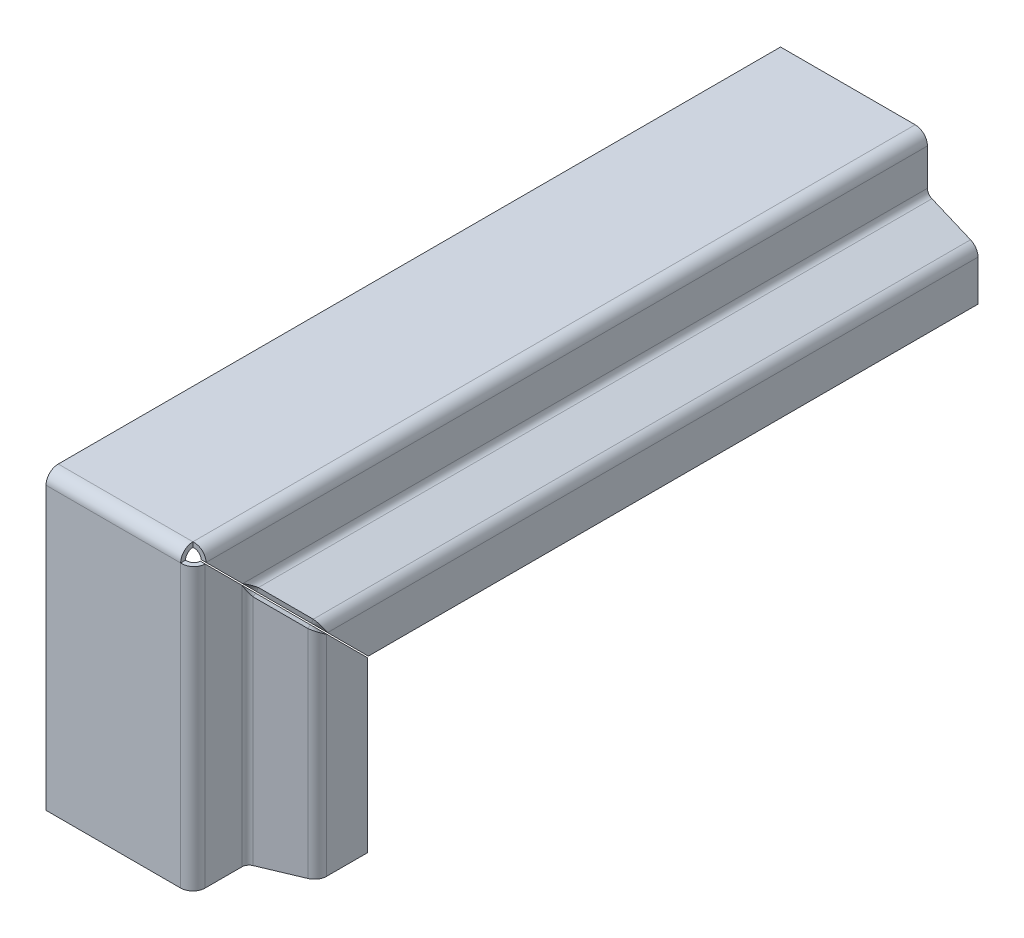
ISO-10303-21;
HEADER;
FILE_DESCRIPTION(('STEP AP214'),'2;1');
FILE_NAME('part.step','',(''),(''),'','','');
FILE_SCHEMA(('AUTOMOTIVE_DESIGN { 1 0 10303 214 1 1 1 1 }'));
ENDSEC;
DATA;
#1=APPLICATION_CONTEXT('core data for automotive mechanical design processes');
#2=APPLICATION_PROTOCOL_DEFINITION('international standard','automotive_design',2000,#1);
#3=PRODUCT_CONTEXT('',#1,'mechanical');
#4=PRODUCT('Part','Part','',(#3));
#5=PRODUCT_RELATED_PRODUCT_CATEGORY('part','',(#4));
#6=PRODUCT_DEFINITION_FORMATION('','',#4);
#7=PRODUCT_DEFINITION_CONTEXT('part definition',#1,'design');
#8=PRODUCT_DEFINITION('design','',#6,#7);
#9=PRODUCT_DEFINITION_SHAPE('','',#8);
#10=(LENGTH_UNIT() NAMED_UNIT(*) SI_UNIT(.MILLI.,.METRE.));
#11=(NAMED_UNIT(*) PLANE_ANGLE_UNIT() SI_UNIT($,.RADIAN.));
#12=(NAMED_UNIT(*) SI_UNIT($,.STERADIAN.) SOLID_ANGLE_UNIT());
#13=UNCERTAINTY_MEASURE_WITH_UNIT(LENGTH_MEASURE(1.E-05),#10,'distance_accuracy_value','');
#14=(GEOMETRIC_REPRESENTATION_CONTEXT(3) GLOBAL_UNCERTAINTY_ASSIGNED_CONTEXT((#13)) GLOBAL_UNIT_ASSIGNED_CONTEXT((#10,
#11,#12)) REPRESENTATION_CONTEXT('',''));
#15=CARTESIAN_POINT('',(0.,0.,0.));
#16=DIRECTION('',(0.,0.,1.));
#17=DIRECTION('',(1.,0.,0.));
#18=AXIS2_PLACEMENT_3D('',#15,#16,#17);
#19=CARTESIAN_POINT('',(-2.5,57.5,-2.5));
#20=DIRECTION('',(1.,0.,0.));
#21=DIRECTION('',(0.,0.,-1.));
#22=AXIS2_PLACEMENT_3D('',#19,#20,#21);
#23=PLANE('',#22);
#24=CARTESIAN_POINT('',(-2.5,57.5,-2.5));
#25=DIRECTION('',(1.,0.,0.));
#26=DIRECTION('',(0.,0.,-1.));
#27=AXIS2_PLACEMENT_3D('',#24,#25,#26);
#28=CIRCLE('',#27,1.5);
#29=CARTESIAN_POINT('',(-2.5,57.5,-1.));
#30=VERTEX_POINT('',#29);
#31=CARTESIAN_POINT('',(-2.5,59.,-2.5));
#32=VERTEX_POINT('',#31);
#33=EDGE_CURVE('E273',#30,#32,#28,.F.);
#34=ORIENTED_EDGE('',*,*,#33,.T.);
#35=DIRECTION('',(0.,1.,0.));
#36=VECTOR('',#35,1.);
#37=CARTESIAN_POINT('',(-2.5,60.,-2.5));
#38=LINE('',#37,#36);
#39=CARTESIAN_POINT('',(-2.5,60.,-2.5));
#40=VERTEX_POINT('',#39);
#41=EDGE_CURVE('E260',#40,#32,#38,.F.);
#42=ORIENTED_EDGE('',*,*,#41,.F.);
#43=CARTESIAN_POINT('',(-2.5,57.5,-2.5));
#44=DIRECTION('',(1.,0.,0.));
#45=DIRECTION('',(0.,0.,-1.));
#46=AXIS2_PLACEMENT_3D('',#43,#44,#45);
#47=CIRCLE('',#46,2.5);
#48=CARTESIAN_POINT('',(-2.5,57.5,0.));
#49=VERTEX_POINT('',#48);
#50=EDGE_CURVE('E280',#49,#40,#47,.F.);
#51=ORIENTED_EDGE('',*,*,#50,.F.);
#52=DIRECTION('',(0.,0.,1.));
#53=VECTOR('',#52,1.);
#54=CARTESIAN_POINT('',(-2.5,57.5,0.));
#55=LINE('',#54,#53);
#56=EDGE_CURVE('E274',#49,#30,#55,.F.);
#57=ORIENTED_EDGE('',*,*,#56,.T.);
#58=EDGE_LOOP('',(#34,#42,#51,#57));
#59=FACE_BOUND('',#58,.T.);
#60=ADVANCED_FACE('F38',(#59),#23,.T.);
#61=CARTESIAN_POINT('',(-30.,59.,0.));
#62=DIRECTION('',(0.,-1.,0.));
#63=DIRECTION('',(0.,0.,-1.));
#64=AXIS2_PLACEMENT_3D('',#61,#62,#63);
#65=PLANE('',#64);
#66=DIRECTION('',(1.,0.,0.));
#67=VECTOR('',#66,1.);
#68=CARTESIAN_POINT('',(-30.,59.,-150.));
#69=LINE('',#68,#67);
#70=CARTESIAN_POINT('',(-30.,59.,-150.));
#71=VERTEX_POINT('',#70);
#72=CARTESIAN_POINT('',(-2.5,59.,-150.));
#73=VERTEX_POINT('',#72);
#74=EDGE_CURVE('E289',#71,#73,#69,.T.);
#75=ORIENTED_EDGE('',*,*,#74,.T.);
#76=DIRECTION('',(0.,0.,-1.));
#77=VECTOR('',#76,1.);
#78=CARTESIAN_POINT('',(-2.5,59.,-2.5));
#79=LINE('',#78,#77);
#80=EDGE_CURVE('E252',#32,#73,#79,.T.);
#81=ORIENTED_EDGE('',*,*,#80,.F.);
#82=DIRECTION('',(1.,0.,0.));
#83=VECTOR('',#82,1.);
#84=CARTESIAN_POINT('',(-30.,59.,-2.5));
#85=LINE('',#84,#83);
#86=CARTESIAN_POINT('',(-30.,59.,-2.5));
#87=VERTEX_POINT('',#86);
#88=EDGE_CURVE('E286',#87,#32,#85,.T.);
#89=ORIENTED_EDGE('',*,*,#88,.F.);
#90=DIRECTION('',(0.,0.,-1.));
#91=VECTOR('',#90,1.);
#92=CARTESIAN_POINT('',(-30.,59.,0.));
#93=LINE('',#92,#91);
#94=EDGE_CURVE('E279',#87,#71,#93,.T.);
#95=ORIENTED_EDGE('',*,*,#94,.T.);
#96=EDGE_LOOP('',(#75,#81,#89,#95));
#97=FACE_BOUND('',#96,.T.);
#98=ADVANCED_FACE('F284',(#97),#65,.T.);
#99=CARTESIAN_POINT('',(-30.,57.5,-2.5));
#100=DIRECTION('',(1.,0.,0.));
#101=DIRECTION('',(0.,0.,-1.));
#102=AXIS2_PLACEMENT_3D('',#99,#100,#101);
#103=CYLINDRICAL_SURFACE('',#102,1.5);
#104=ORIENTED_EDGE('',*,*,#88,.T.);
#105=ORIENTED_EDGE('',*,*,#33,.F.);
#106=DIRECTION('',(1.,0.,0.));
#107=VECTOR('',#106,1.);
#108=CARTESIAN_POINT('',(-30.,57.5,-1.));
#109=LINE('',#108,#107);
#110=CARTESIAN_POINT('',(-30.,57.5,-1.));
#111=VERTEX_POINT('',#110);
#112=EDGE_CURVE('E295',#111,#30,#109,.T.);
#113=ORIENTED_EDGE('',*,*,#112,.F.);
#114=CARTESIAN_POINT('',(-30.,57.5,-2.5));
#115=DIRECTION('',(1.,0.,0.));
#116=DIRECTION('',(0.,0.,-1.));
#117=AXIS2_PLACEMENT_3D('',#114,#115,#116);
#118=CIRCLE('',#117,1.5);
#119=EDGE_CURVE('E294',#111,#87,#118,.F.);
#120=ORIENTED_EDGE('',*,*,#119,.T.);
#121=EDGE_LOOP('',(#104,#105,#113,#120));
#122=FACE_BOUND('',#121,.T.);
#123=ADVANCED_FACE('F293',(#122),#103,.F.);
#124=CARTESIAN_POINT('',(-30.,0.,-1.));
#125=DIRECTION('',(0.,0.,-1.));
#126=DIRECTION('',(-1.,0.,0.));
#127=AXIS2_PLACEMENT_3D('',#124,#125,#126);
#128=PLANE('',#127);
#129=ORIENTED_EDGE('',*,*,#112,.T.);
#130=DIRECTION('',(0.,1.,0.));
#131=VECTOR('',#130,1.);
#132=CARTESIAN_POINT('',(-2.5,-737.5,-1.));
#133=LINE('',#132,#131);
#134=CARTESIAN_POINT('',(-2.5,0.,-1.));
#135=VERTEX_POINT('',#134);
#136=EDGE_CURVE('E464',#135,#30,#133,.T.);
#137=ORIENTED_EDGE('',*,*,#136,.F.);
#138=DIRECTION('',(1.,0.,0.));
#139=VECTOR('',#138,1.);
#140=CARTESIAN_POINT('',(-30.,0.,-1.));
#141=LINE('',#140,#139);
#142=CARTESIAN_POINT('',(-30.,0.,-1.));
#143=VERTEX_POINT('',#142);
#144=EDGE_CURVE('E297',#143,#135,#141,.T.);
#145=ORIENTED_EDGE('',*,*,#144,.F.);
#146=DIRECTION('',(0.,1.,0.));
#147=VECTOR('',#146,1.);
#148=CARTESIAN_POINT('',(-30.,0.,-1.));
#149=LINE('',#148,#147);
#150=EDGE_CURVE('E316',#143,#111,#149,.T.);
#151=ORIENTED_EDGE('',*,*,#150,.T.);
#152=EDGE_LOOP('',(#129,#137,#145,#151));
#153=FACE_BOUND('',#152,.T.);
#154=ADVANCED_FACE('F680',(#153),#128,.T.);
#155=CARTESIAN_POINT('',(-30.,0.,-1.));
#156=DIRECTION('',(0.,1.,0.));
#157=DIRECTION('',(0.,0.,1.));
#158=AXIS2_PLACEMENT_3D('',#155,#156,#157);
#159=PLANE('',#158);
#160=DIRECTION('',(0.,0.,1.));
#161=VECTOR('',#160,1.);
#162=CARTESIAN_POINT('',(-2.5,0.,0.));
#163=LINE('',#162,#161);
#164=CARTESIAN_POINT('',(-2.5,0.,0.));
#165=VERTEX_POINT('',#164);
#166=EDGE_CURVE('E412',#165,#135,#163,.F.);
#167=ORIENTED_EDGE('',*,*,#166,.F.);
#168=DIRECTION('',(1.,0.,0.));
#169=VECTOR('',#168,1.);
#170=CARTESIAN_POINT('',(-30.,0.,0.));
#171=LINE('',#170,#169);
#172=CARTESIAN_POINT('',(-30.,0.,0.));
#173=VERTEX_POINT('',#172);
#174=EDGE_CURVE('E304',#173,#165,#171,.T.);
#175=ORIENTED_EDGE('',*,*,#174,.F.);
#176=DIRECTION('',(0.,0.,1.));
#177=VECTOR('',#176,1.);
#178=CARTESIAN_POINT('',(-30.,0.,-1.));
#179=LINE('',#178,#177);
#180=EDGE_CURVE('E318',#143,#173,#179,.T.);
#181=ORIENTED_EDGE('',*,*,#180,.F.);
#182=ORIENTED_EDGE('',*,*,#144,.T.);
#183=EDGE_LOOP('',(#167,#175,#181,#182));
#184=FACE_BOUND('',#183,.T.);
#185=ADVANCED_FACE('F683',(#184),#159,.F.);
#186=CARTESIAN_POINT('',(-30.,0.,0.));
#187=DIRECTION('',(0.,0.,-1.));
#188=DIRECTION('',(-1.,0.,0.));
#189=AXIS2_PLACEMENT_3D('',#186,#187,#188);
#190=PLANE('',#189);
#191=DIRECTION('',(0.,1.,0.));
#192=VECTOR('',#191,1.);
#193=CARTESIAN_POINT('',(-2.5,-737.5,0.));
#194=LINE('',#193,#192);
#195=EDGE_CURVE('E468',#165,#49,#194,.T.);
#196=ORIENTED_EDGE('',*,*,#195,.T.);
#197=DIRECTION('',(1.,0.,0.));
#198=VECTOR('',#197,1.);
#199=CARTESIAN_POINT('',(-30.,57.5,0.));
#200=LINE('',#199,#198);
#201=CARTESIAN_POINT('',(-30.,57.5,0.));
#202=VERTEX_POINT('',#201);
#203=EDGE_CURVE('E307',#202,#49,#200,.T.);
#204=ORIENTED_EDGE('',*,*,#203,.F.);
#205=DIRECTION('',(0.,1.,0.));
#206=VECTOR('',#205,1.);
#207=CARTESIAN_POINT('',(-30.,0.,0.));
#208=LINE('',#207,#206);
#209=EDGE_CURVE('E321',#173,#202,#208,.T.);
#210=ORIENTED_EDGE('',*,*,#209,.F.);
#211=ORIENTED_EDGE('',*,*,#174,.T.);
#212=EDGE_LOOP('',(#196,#204,#210,#211));
#213=FACE_BOUND('',#212,.T.);
#214=ADVANCED_FACE('F686',(#213),#190,.F.);
#215=CARTESIAN_POINT('',(-30.,57.5,-2.5));
#216=DIRECTION('',(1.,0.,0.));
#217=DIRECTION('',(0.,0.,-1.));
#218=AXIS2_PLACEMENT_3D('',#215,#216,#217);
#219=CYLINDRICAL_SURFACE('',#218,2.5);
#220=ORIENTED_EDGE('',*,*,#50,.T.);
#221=DIRECTION('',(1.,0.,0.));
#222=VECTOR('',#221,1.);
#223=CARTESIAN_POINT('',(-30.,60.,-2.5));
#224=LINE('',#223,#222);
#225=CARTESIAN_POINT('',(-30.,60.,-2.5));
#226=VERTEX_POINT('',#225);
#227=EDGE_CURVE('E310',#226,#40,#224,.T.);
#228=ORIENTED_EDGE('',*,*,#227,.F.);
#229=CARTESIAN_POINT('',(-30.,57.5,-2.5));
#230=DIRECTION('',(1.,0.,0.));
#231=DIRECTION('',(0.,0.,-1.));
#232=AXIS2_PLACEMENT_3D('',#229,#230,#231);
#233=CIRCLE('',#232,2.5);
#234=EDGE_CURVE('E326',#202,#226,#233,.F.);
#235=ORIENTED_EDGE('',*,*,#234,.F.);
#236=ORIENTED_EDGE('',*,*,#203,.T.);
#237=EDGE_LOOP('',(#220,#228,#235,#236));
#238=FACE_BOUND('',#237,.T.);
#239=ADVANCED_FACE('F690',(#238),#219,.T.);
#240=CARTESIAN_POINT('',(-30.,60.,0.));
#241=DIRECTION('',(0.,-1.,0.));
#242=DIRECTION('',(0.,0.,-1.));
#243=AXIS2_PLACEMENT_3D('',#240,#241,#242);
#244=PLANE('',#243);
#245=DIRECTION('',(0.,0.,-1.));
#246=VECTOR('',#245,1.);
#247=CARTESIAN_POINT('',(-2.5,60.,-2.5));
#248=LINE('',#247,#246);
#249=CARTESIAN_POINT('',(-2.5,60.,-149.999999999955));
#250=VERTEX_POINT('',#249);
#251=EDGE_CURVE('E598',#40,#250,#248,.T.);
#252=ORIENTED_EDGE('',*,*,#251,.T.);
#253=DIRECTION('',(1.,0.,0.));
#254=VECTOR('',#253,1.);
#255=CARTESIAN_POINT('',(-30.,60.,-150.));
#256=LINE('',#255,#254);
#257=CARTESIAN_POINT('',(-30.,60.,-150.));
#258=VERTEX_POINT('',#257);
#259=EDGE_CURVE('E313',#258,#250,#256,.T.);
#260=ORIENTED_EDGE('',*,*,#259,.F.);
#261=DIRECTION('',(0.,0.,-1.));
#262=VECTOR('',#261,1.);
#263=CARTESIAN_POINT('',(-30.,60.,0.));
#264=LINE('',#263,#262);
#265=EDGE_CURVE('E328',#226,#258,#264,.T.);
#266=ORIENTED_EDGE('',*,*,#265,.F.);
#267=ORIENTED_EDGE('',*,*,#227,.T.);
#268=EDGE_LOOP('',(#252,#260,#266,#267));
#269=FACE_BOUND('',#268,.T.);
#270=ADVANCED_FACE('F694',(#269),#244,.F.);
#271=CARTESIAN_POINT('',(-30.,60.,-150.));
#272=DIRECTION('',(0.,0.,1.));
#273=DIRECTION('',(1.,0.,0.));
#274=AXIS2_PLACEMENT_3D('',#271,#272,#273);
#275=PLANE('',#274);
#276=DIRECTION('',(0.,1.,0.));
#277=VECTOR('',#276,1.);
#278=CARTESIAN_POINT('',(-2.5,60.,-149.999999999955));
#279=LINE('',#278,#277);
#280=EDGE_CURVE('E269',#250,#73,#279,.F.);
#281=ORIENTED_EDGE('',*,*,#280,.T.);
#282=ORIENTED_EDGE('',*,*,#74,.F.);
#283=DIRECTION('',(0.,-1.,0.));
#284=VECTOR('',#283,1.);
#285=CARTESIAN_POINT('',(-30.,60.,-150.));
#286=LINE('',#285,#284);
#287=EDGE_CURVE('E330',#258,#71,#286,.T.);
#288=ORIENTED_EDGE('',*,*,#287,.F.);
#289=ORIENTED_EDGE('',*,*,#259,.T.);
#290=EDGE_LOOP('',(#281,#282,#288,#289));
#291=FACE_BOUND('',#290,.T.);
#292=ADVANCED_FACE('F698',(#291),#275,.F.);
#293=CARTESIAN_POINT('',(-30.,57.5,0.));
#294=DIRECTION('',(-1.,0.,0.));
#295=DIRECTION('',(0.,0.,1.));
#296=AXIS2_PLACEMENT_3D('',#293,#294,#295);
#297=PLANE('',#296);
#298=DIRECTION('',(0.,0.,-1.));
#299=VECTOR('',#298,1.);
#300=CARTESIAN_POINT('',(-30.,57.5,0.));
#301=LINE('',#300,#299);
#302=EDGE_CURVE('E11',#202,#111,#301,.T.);
#303=ORIENTED_EDGE('',*,*,#302,.F.);
#304=ORIENTED_EDGE('',*,*,#234,.T.);
#305=DIRECTION('',(0.,1.,0.));
#306=VECTOR('',#305,1.);
#307=CARTESIAN_POINT('',(-30.,59.,-2.5));
#308=LINE('',#307,#306);
#309=EDGE_CURVE('E46',#87,#226,#308,.T.);
#310=ORIENTED_EDGE('',*,*,#309,.F.);
#311=ORIENTED_EDGE('',*,*,#119,.F.);
#312=EDGE_LOOP('',(#303,#304,#310,#311));
#313=FACE_BOUND('',#312,.T.);
#314=ADVANCED_FACE('F40',(#313),#297,.T.);
#315=CARTESIAN_POINT('',(-30.,59.,-2.5));
#316=DIRECTION('',(-1.,0.,0.));
#317=DIRECTION('',(0.,0.,1.));
#318=AXIS2_PLACEMENT_3D('',#315,#316,#317);
#319=PLANE('',#318);
#320=ORIENTED_EDGE('',*,*,#209,.T.);
#321=ORIENTED_EDGE('',*,*,#302,.T.);
#322=ORIENTED_EDGE('',*,*,#150,.F.);
#323=ORIENTED_EDGE('',*,*,#180,.T.);
#324=EDGE_LOOP('',(#320,#321,#322,#323));
#325=FACE_BOUND('',#324,.T.);
#326=ADVANCED_FACE('F676',(#325),#319,.T.);
#327=CARTESIAN_POINT('',(-30.,57.5,-2.5));
#328=DIRECTION('',(1.,0.,0.));
#329=DIRECTION('',(0.,0.,-1.));
#330=AXIS2_PLACEMENT_3D('',#327,#328,#329);
#331=PLANE('',#330);
#332=ORIENTED_EDGE('',*,*,#94,.F.);
#333=ORIENTED_EDGE('',*,*,#309,.T.);
#334=ORIENTED_EDGE('',*,*,#265,.T.);
#335=ORIENTED_EDGE('',*,*,#287,.T.);
#336=EDGE_LOOP('',(#332,#333,#334,#335));
#337=FACE_BOUND('',#336,.T.);
#338=ADVANCED_FACE('F672',(#337),#331,.F.);
#339=CARTESIAN_POINT('',(0.,0.,-9.98668885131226));
#340=DIRECTION('',(0.,-1.,0.));
#341=DIRECTION('',(0.,0.,1.));
#342=AXIS2_PLACEMENT_3D('',#339,#340,#341);
#343=PLANE('',#342);
#344=DIRECTION('',(1.,0.,0.));
#345=VECTOR('',#344,1.);
#346=CARTESIAN_POINT('',(0.,0.,-2.5));
#347=LINE('',#346,#345);
#348=CARTESIAN_POINT('',(0.,0.,-2.5));
#349=VERTEX_POINT('',#348);
#350=CARTESIAN_POINT('',(-1.,0.,-2.5));
#351=VERTEX_POINT('',#350);
#352=EDGE_CURVE('E342',#349,#351,#347,.F.);
#353=ORIENTED_EDGE('',*,*,#352,.T.);
#354=DIRECTION('',(0.,0.,1.));
#355=VECTOR('',#354,1.);
#356=CARTESIAN_POINT('',(-1.,0.,-9.98668885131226));
#357=LINE('',#356,#355);
#358=CARTESIAN_POINT('',(-1.,0.,-9.98668885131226));
#359=VERTEX_POINT('',#358);
#360=EDGE_CURVE('E424',#359,#351,#357,.T.);
#361=ORIENTED_EDGE('',*,*,#360,.F.);
#362=DIRECTION('',(1.,0.,0.));
#363=VECTOR('',#362,1.);
#364=CARTESIAN_POINT('',(0.,0.,-9.98668885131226));
#365=LINE('',#364,#363);
#366=CARTESIAN_POINT('',(0.,0.,-9.98668885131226));
#367=VERTEX_POINT('',#366);
#368=EDGE_CURVE('E345',#367,#359,#365,.F.);
#369=ORIENTED_EDGE('',*,*,#368,.F.);
#370=DIRECTION('',(0.,0.,1.));
#371=VECTOR('',#370,1.);
#372=CARTESIAN_POINT('',(0.,0.,-9.98668885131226));
#373=LINE('',#372,#371);
#374=EDGE_CURVE('E379',#367,#349,#373,.T.);
#375=ORIENTED_EDGE('',*,*,#374,.T.);
#376=EDGE_LOOP('',(#353,#361,#369,#375));
#377=FACE_BOUND('',#376,.T.);
#378=ADVANCED_FACE('F675',(#377),#343,.T.);
#379=CARTESIAN_POINT('',(1.5,0.,-9.98668885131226));
#380=DIRECTION('',(0.,-1.,0.));
#381=DIRECTION('',(0.,0.,-1.));
#382=AXIS2_PLACEMENT_3D('',#379,#380,#381);
#383=PLANE('',#382);
#384=ORIENTED_EDGE('',*,*,#368,.T.);
#385=CARTESIAN_POINT('',(1.5,0.,-9.98668885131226));
#386=DIRECTION('',(0.,1.,0.));
#387=DIRECTION('',(0.,0.,1.));
#388=AXIS2_PLACEMENT_3D('',#385,#386,#387);
#389=CIRCLE('',#388,2.5);
#390=CARTESIAN_POINT('',(0.529020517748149,0.,-12.2904246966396));
#391=VERTEX_POINT('',#390);
#392=EDGE_CURVE('E426',#359,#391,#389,.F.);
#393=ORIENTED_EDGE('',*,*,#392,.T.);
#394=DIRECTION('',(0.388391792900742,0.,0.921494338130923));
#395=VECTOR('',#394,1.);
#396=CARTESIAN_POINT('',(0.917412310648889,0.,-11.3689303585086));
#397=LINE('',#396,#395);
#398=CARTESIAN_POINT('',(0.917412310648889,0.,-11.3689303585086));
#399=VERTEX_POINT('',#398);
#400=EDGE_CURVE('E348',#399,#391,#397,.F.);
#401=ORIENTED_EDGE('',*,*,#400,.F.);
#402=CARTESIAN_POINT('',(1.5,0.,-9.98668885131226));
#403=DIRECTION('',(0.,1.,0.));
#404=DIRECTION('',(0.,0.,1.));
#405=AXIS2_PLACEMENT_3D('',#402,#403,#404);
#406=CIRCLE('',#405,1.5);
#407=EDGE_CURVE('E381',#367,#399,#406,.F.);
#408=ORIENTED_EDGE('',*,*,#407,.F.);
#409=EDGE_LOOP('',(#384,#393,#401,#408));
#410=FACE_BOUND('',#409,.T.);
#411=ADVANCED_FACE('F914',(#410),#383,.T.);
#412=CARTESIAN_POINT('',(0.,0.,-10.9822590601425));
#413=DIRECTION('',(0.,-1.,0.));
#414=DIRECTION('',(0.921494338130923,0.,-0.388391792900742));
#415=AXIS2_PLACEMENT_3D('',#412,#413,#414);
#416=PLANE('',#415);
#417=ORIENTED_EDGE('',*,*,#400,.T.);
#418=DIRECTION('',(0.921494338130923,0.,-0.388391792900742));
#419=VECTOR('',#418,1.);
#420=CARTESIAN_POINT('',(-0.388391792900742,0.,-11.9037533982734));
#421=LINE('',#420,#419);
#422=CARTESIAN_POINT('',(8.40784249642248,0.,-15.6111936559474));
#423=VERTEX_POINT('',#422);
#424=EDGE_CURVE('E430',#391,#423,#421,.T.);
#425=ORIENTED_EDGE('',*,*,#424,.T.);
#426=DIRECTION('',(0.388391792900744,0.,0.921494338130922));
#427=VECTOR('',#426,1.);
#428=CARTESIAN_POINT('',(8.79623428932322,0.,-14.6896993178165));
#429=LINE('',#428,#427);
#430=CARTESIAN_POINT('',(8.79623428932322,0.,-14.6896993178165));
#431=VERTEX_POINT('',#430);
#432=EDGE_CURVE('E351',#431,#423,#429,.F.);
#433=ORIENTED_EDGE('',*,*,#432,.F.);
#434=DIRECTION('',(0.921494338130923,0.,-0.388391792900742));
#435=VECTOR('',#434,1.);
#436=CARTESIAN_POINT('',(0.,0.,-10.9822590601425));
#437=LINE('',#436,#435);
#438=EDGE_CURVE('E385',#399,#431,#437,.T.);
#439=ORIENTED_EDGE('',*,*,#438,.F.);
#440=EDGE_LOOP('',(#417,#425,#433,#439));
#441=FACE_BOUND('',#440,.T.);
#442=ADVANCED_FACE('F910',(#441),#416,.T.);
#443=CARTESIAN_POINT('',(7.82525480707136,0.,-16.9934351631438));
#444=DIRECTION('',(0.,-1.,0.));
#445=DIRECTION('',(0.,0.,-1.));
#446=AXIS2_PLACEMENT_3D('',#443,#444,#445);
#447=PLANE('',#446);
#448=ORIENTED_EDGE('',*,*,#432,.T.);
#449=CARTESIAN_POINT('',(7.82525480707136,0.,-16.9934351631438));
#450=DIRECTION('',(0.,1.,0.));
#451=DIRECTION('',(0.,0.,1.));
#452=AXIS2_PLACEMENT_3D('',#449,#450,#451);
#453=CIRCLE('',#452,1.5);
#454=CARTESIAN_POINT('',(9.32525480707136,0.,-16.9934351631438));
#455=VERTEX_POINT('',#454);
#456=EDGE_CURVE('E434',#423,#455,#453,.T.);
#457=ORIENTED_EDGE('',*,*,#456,.T.);
#458=DIRECTION('',(1.,0.,0.));
#459=VECTOR('',#458,1.);
#460=CARTESIAN_POINT('',(10.3252548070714,0.,-16.9934351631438));
#461=LINE('',#460,#459);
#462=CARTESIAN_POINT('',(10.3252548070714,0.,-16.9934351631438));
#463=VERTEX_POINT('',#462);
#464=EDGE_CURVE('E354',#463,#455,#461,.F.);
#465=ORIENTED_EDGE('',*,*,#464,.F.);
#466=CARTESIAN_POINT('',(7.82525480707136,0.,-16.9934351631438));
#467=DIRECTION('',(0.,1.,0.));
#468=DIRECTION('',(0.,0.,1.));
#469=AXIS2_PLACEMENT_3D('',#466,#467,#468);
#470=CIRCLE('',#469,2.5);
#471=EDGE_CURVE('E389',#431,#463,#470,.T.);
#472=ORIENTED_EDGE('',*,*,#471,.F.);
#473=EDGE_LOOP('',(#448,#457,#465,#472));
#474=FACE_BOUND('',#473,.T.);
#475=ADVANCED_FACE('F906',(#474),#447,.T.);
#476=CARTESIAN_POINT('',(10.3252548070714,0.,-15.3341514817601));
#477=DIRECTION('',(0.,-1.,0.));
#478=DIRECTION('',(0.,0.,-1.));
#479=AXIS2_PLACEMENT_3D('',#476,#477,#478);
#480=PLANE('',#479);
#481=ORIENTED_EDGE('',*,*,#464,.T.);
#482=DIRECTION('',(0.,0.,-1.));
#483=VECTOR('',#482,1.);
#484=CARTESIAN_POINT('',(9.32525480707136,0.,-15.3341514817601));
#485=LINE('',#484,#483);
#486=CARTESIAN_POINT('',(9.32525480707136,0.,-25.3181013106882));
#487=VERTEX_POINT('',#486);
#488=EDGE_CURVE('E438',#455,#487,#485,.T.);
#489=ORIENTED_EDGE('',*,*,#488,.T.);
#490=DIRECTION('',(1.,0.,0.));
#491=VECTOR('',#490,1.);
#492=CARTESIAN_POINT('',(10.3252548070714,0.,-25.3181013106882));
#493=LINE('',#492,#491);
#494=CARTESIAN_POINT('',(10.3252548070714,0.,-25.3181013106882));
#495=VERTEX_POINT('',#494);
#496=EDGE_CURVE('E357',#495,#487,#493,.F.);
#497=ORIENTED_EDGE('',*,*,#496,.F.);
#498=DIRECTION('',(0.,0.,-1.));
#499=VECTOR('',#498,1.);
#500=CARTESIAN_POINT('',(10.3252548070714,0.,-15.3341514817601));
#501=LINE('',#500,#499);
#502=EDGE_CURVE('E393',#463,#495,#501,.T.);
#503=ORIENTED_EDGE('',*,*,#502,.F.);
#504=EDGE_LOOP('',(#481,#489,#497,#503));
#505=FACE_BOUND('',#504,.T.);
#506=ADVANCED_FACE('F902',(#505),#480,.T.);
#507=CARTESIAN_POINT('',(10.3252548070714,0.,-25.3181013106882));
#508=DIRECTION('',(0.,0.,-1.));
#509=DIRECTION('',(0.,1.,0.));
#510=AXIS2_PLACEMENT_3D('',#507,#508,#509);
#511=PLANE('',#510);
#512=ORIENTED_EDGE('',*,*,#496,.T.);
#513=DIRECTION('',(0.,1.,0.));
#514=VECTOR('',#513,1.);
#515=CARTESIAN_POINT('',(9.32525480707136,0.,-25.3181013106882));
#516=LINE('',#515,#514);
#517=CARTESIAN_POINT('',(9.32525480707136,34.5051219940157,-25.3181013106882));
#518=VERTEX_POINT('',#517);
#519=EDGE_CURVE('E441',#487,#518,#516,.T.);
#520=ORIENTED_EDGE('',*,*,#519,.T.);
#521=DIRECTION('',(1.,0.,0.));
#522=VECTOR('',#521,1.);
#523=CARTESIAN_POINT('',(10.3252548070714,34.5051219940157,-25.3181013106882));
#524=LINE('',#523,#522);
#525=CARTESIAN_POINT('',(10.3252548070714,34.5051219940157,-25.3181013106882));
#526=VERTEX_POINT('',#525);
#527=EDGE_CURVE('E360',#526,#518,#524,.F.);
#528=ORIENTED_EDGE('',*,*,#527,.F.);
#529=DIRECTION('',(0.,1.,0.));
#530=VECTOR('',#529,1.);
#531=CARTESIAN_POINT('',(10.3252548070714,0.,-25.3181013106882));
#532=LINE('',#531,#530);
#533=EDGE_CURVE('E396',#495,#526,#532,.T.);
#534=ORIENTED_EDGE('',*,*,#533,.F.);
#535=EDGE_LOOP('',(#512,#520,#528,#534));
#536=FACE_BOUND('',#535,.T.);
#537=ADVANCED_FACE('F898',(#536),#511,.T.);
#538=CARTESIAN_POINT('',(10.3252548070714,22.244535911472,-37.578687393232));
#539=DIRECTION('',(0.,0.707106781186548,-0.707106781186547));
#540=DIRECTION('',(0.,0.707106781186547,0.707106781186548));
#541=AXIS2_PLACEMENT_3D('',#538,#539,#540);
#542=PLANE('',#541);
#543=ORIENTED_EDGE('',*,*,#527,.T.);
#544=DIRECTION('',(0.,0.707106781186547,0.707106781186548));
#545=VECTOR('',#544,1.);
#546=CARTESIAN_POINT('',(9.32525480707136,22.244535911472,-37.578687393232));
#547=LINE('',#546,#545);
#548=CARTESIAN_POINT('',(9.32525480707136,42.8297881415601,-16.9934351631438));
#549=VERTEX_POINT('',#548);
#550=EDGE_CURVE('E420',#518,#549,#547,.T.);
#551=ORIENTED_EDGE('',*,*,#550,.T.);
#552=DIRECTION('',(1.,0.,0.));
#553=VECTOR('',#552,1.);
#554=CARTESIAN_POINT('',(10.3252548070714,42.8297881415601,-16.9934351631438));
#555=LINE('',#554,#553);
#556=CARTESIAN_POINT('',(10.3252548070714,42.8297881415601,-16.9934351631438));
#557=VERTEX_POINT('',#556);
#558=EDGE_CURVE('E363',#557,#549,#555,.F.);
#559=ORIENTED_EDGE('',*,*,#558,.F.);
#560=DIRECTION('',(0.,0.707106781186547,0.707106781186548));
#561=VECTOR('',#560,1.);
#562=CARTESIAN_POINT('',(10.3252548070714,22.244535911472,-37.578687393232));
#563=LINE('',#562,#561);
#564=EDGE_CURVE('E375',#526,#557,#563,.T.);
#565=ORIENTED_EDGE('',*,*,#564,.F.);
#566=EDGE_LOOP('',(#543,#551,#559,#565));
#567=FACE_BOUND('',#566,.T.);
#568=ADVANCED_FACE('F889',(#567),#542,.T.);
#569=CARTESIAN_POINT('',(7.82525480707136,44.3297881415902,-14.4934351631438));
#570=CARTESIAN_POINT('',(7.82525480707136,44.3297881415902,-14.8267684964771));
#571=CARTESIAN_POINT('',(7.82525480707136,44.3297881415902,-15.1601018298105));
#572=CARTESIAN_POINT('',(7.82525480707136,44.3297881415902,-15.4934351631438));
#573=CARTESIAN_POINT('',(2.82525480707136,44.3297881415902,-14.4934351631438));
#574=CARTESIAN_POINT('',(3.49192147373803,44.3297881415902,-14.8267684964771));
#575=CARTESIAN_POINT('',(4.1585881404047,44.3297881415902,-15.1601018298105));
#576=CARTESIAN_POINT('',(4.82525480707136,44.3297881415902,-15.4934351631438));
#577=CARTESIAN_POINT('',(2.82525480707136,41.3297881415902,-19.4934351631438));
#578=CARTESIAN_POINT('',(3.49192147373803,41.3297881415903,-19.1601018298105));
#579=CARTESIAN_POINT('',(4.1585881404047,41.3297881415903,-18.8267684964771));
#580=CARTESIAN_POINT('',(4.82525480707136,41.3297881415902,-18.4934351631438));
#581=CARTESIAN_POINT('',(7.82525480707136,41.3297881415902,-19.4934351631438));
#582=CARTESIAN_POINT('',(7.82525480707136,41.3297881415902,-19.1601018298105));
#583=CARTESIAN_POINT('',(7.82525480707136,41.3297881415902,-18.8267684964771));
#584=CARTESIAN_POINT('',(7.82525480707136,41.3297881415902,-18.4934351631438));
#585=CARTESIAN_POINT('',(12.8252548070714,41.3297881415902,-19.4934351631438));
#586=CARTESIAN_POINT('',(12.1585881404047,41.3297881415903,-19.1601018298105));
#587=CARTESIAN_POINT('',(11.491921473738,41.3297881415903,-18.8267684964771));
#588=CARTESIAN_POINT('',(10.8252548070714,41.3297881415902,-18.4934351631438));
#589=CARTESIAN_POINT('',(12.8252548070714,44.3297881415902,-14.4934351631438));
#590=CARTESIAN_POINT('',(12.1585881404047,44.3297881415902,-14.8267684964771));
#591=CARTESIAN_POINT('',(11.491921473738,44.3297881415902,-15.1601018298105));
#592=CARTESIAN_POINT('',(10.8252548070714,44.3297881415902,-15.4934351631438));
#593=CARTESIAN_POINT('',(7.82525480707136,44.3297881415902,-14.4934351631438));
#594=CARTESIAN_POINT('',(7.82525480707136,44.3297881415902,-14.8267684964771));
#595=CARTESIAN_POINT('',(7.82525480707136,44.3297881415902,-15.1601018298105));
#596=CARTESIAN_POINT('',(7.82525480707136,44.3297881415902,-15.4934351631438));
#597=(BOUNDED_SURFACE() B_SPLINE_SURFACE(3,3,((#569,#570,#571,#572),(#573,#574,#575,#576),(#577,
#578,#579,#580),(#581,#582,#583,#584),(#585,#586,#587,#588),(#589,#590,#591,#592),(#593,#594,
#595,#596)),.UNSPECIFIED.,.T.,.F.,.F.) B_SPLINE_SURFACE_WITH_KNOTS((4,3,4),(4,4),(0.,0.5,1.),
(0.,1.),.UNSPECIFIED.) GEOMETRIC_REPRESENTATION_ITEM() RATIONAL_B_SPLINE_SURFACE(((1.,1.,1.,1.),
(0.333333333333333,0.333333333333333,0.333333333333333,0.333333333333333),(0.333333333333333,
0.333333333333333,0.333333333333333,0.333333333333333),(1.,1.,1.,1.),(0.333333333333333,
0.333333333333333,0.333333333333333,0.333333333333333),(0.333333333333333,0.333333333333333,
0.333333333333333,0.333333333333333),(1.,1.,1.,1.))) REPRESENTATION_ITEM('') SURFACE());
#598=CARTESIAN_POINT('',(7.82525480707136,42.8297881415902,-16.9934351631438));
#599=DIRECTION('',(0.,0.707106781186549,-0.707106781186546));
#600=DIRECTION('',(0.,0.707106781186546,0.707106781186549));
#601=AXIS2_PLACEMENT_3D('',#598,#599,#600);
#602=ELLIPSE('',#601,2.12132034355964,1.5);
#603=CARTESIAN_POINT('',(8.40784249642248,44.2120296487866,-15.6111936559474));
#604=VERTEX_POINT('',#603);
#605=EDGE_CURVE('E419',#549,#604,#602,.F.);
#606=DIRECTION('',(0.388391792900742,0.,0.921494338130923));
#607=VECTOR('',#606,1.);
#608=CARTESIAN_POINT('',(8.79623428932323,44.2120296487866,-14.6896993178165));
#609=LINE('',#608,#607);
#610=CARTESIAN_POINT('',(8.79623428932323,44.2120296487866,-14.6896993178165));
#611=VERTEX_POINT('',#610);
#612=EDGE_CURVE('E366',#611,#604,#609,.F.);
#613=CARTESIAN_POINT('',(7.82525480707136,42.8297881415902,-16.9934351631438));
#614=DIRECTION('',(0.,0.857492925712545,-0.514495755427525));
#615=DIRECTION('',(0.,0.514495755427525,0.857492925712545));
#616=AXIS2_PLACEMENT_3D('',#613,#614,#615);
#617=ELLIPSE('',#616,2.91547594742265,2.5);
#618=EDGE_CURVE('E374',#557,#611,#617,.F.);
#619=ORIENTED_EDGE('',*,*,#558,.T.);
#620=ORIENTED_EDGE('',*,*,#605,.T.);
#621=ORIENTED_EDGE('',*,*,#612,.F.);
#622=ORIENTED_EDGE('',*,*,#618,.F.);
#623=EDGE_LOOP('',(#619,#620,#621,#622));
#624=FACE_BOUND('',#623,.T.);
#625=ADVANCED_FACE('F883',(#624),#597,.F.);
#626=CARTESIAN_POINT('',(14.9024160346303,41.638393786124,-17.263335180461));
#627=DIRECTION('',(0.333621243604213,0.932161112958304,-0.140614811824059));
#628=DIRECTION('',(-0.858981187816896,0.362043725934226,0.362043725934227));
#629=AXIS2_PLACEMENT_3D('',#626,#627,#628);
#630=PLANE('',#629);
#631=ORIENTED_EDGE('',*,*,#612,.T.);
#632=DIRECTION('',(-0.858981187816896,0.362043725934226,0.362043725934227));
#633=VECTOR('',#632,1.);
#634=CARTESIAN_POINT('',(14.5140242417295,41.638393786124,-18.1848295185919));
#635=LINE('',#634,#633);
#636=CARTESIAN_POINT('',(0.529020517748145,47.5327986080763,-12.2904246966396));
#637=VERTEX_POINT('',#636);
#638=EDGE_CURVE('E448',#604,#637,#635,.T.);
#639=ORIENTED_EDGE('',*,*,#638,.T.);
#640=DIRECTION('',(0.388391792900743,0.,0.921494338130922));
#641=VECTOR('',#640,1.);
#642=CARTESIAN_POINT('',(0.917412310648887,47.5327986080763,-11.3689303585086));
#643=LINE('',#642,#641);
#644=CARTESIAN_POINT('',(0.917412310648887,47.5327986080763,-11.3689303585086));
#645=VERTEX_POINT('',#644);
#646=EDGE_CURVE('E338',#645,#637,#643,.F.);
#647=ORIENTED_EDGE('',*,*,#646,.F.);
#648=DIRECTION('',(-0.858981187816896,0.362043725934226,0.362043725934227));
#649=VECTOR('',#648,1.);
#650=CARTESIAN_POINT('',(14.9024160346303,41.638393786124,-17.263335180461));
#651=LINE('',#650,#649);
#652=EDGE_CURVE('E404',#611,#645,#651,.T.);
#653=ORIENTED_EDGE('',*,*,#652,.F.);
#654=EDGE_LOOP('',(#631,#639,#647,#653));
#655=FACE_BOUND('',#654,.T.);
#656=ADVANCED_FACE('F874',(#655),#630,.T.);
#657=CARTESIAN_POINT('',(1.5,52.3365344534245,-8.48668885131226));
#658=CARTESIAN_POINT('',(1.5,52.3365344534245,-8.15335551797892));
#659=CARTESIAN_POINT('',(1.5,52.3365344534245,-7.82002218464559));
#660=CARTESIAN_POINT('',(1.5,52.3365344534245,-7.48668885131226));
#661=CARTESIAN_POINT('',(4.5,52.3365344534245,-8.48668885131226));
#662=CARTESIAN_POINT('',(5.16666666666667,52.3365344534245,-8.15335551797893));
#663=CARTESIAN_POINT('',(5.83333333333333,52.3365344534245,-7.82002218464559));
#664=CARTESIAN_POINT('',(6.5,52.3365344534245,-7.48668885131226));
#665=CARTESIAN_POINT('',(4.5,47.3365344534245,-11.4866888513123));
#666=CARTESIAN_POINT('',(5.16666666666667,47.3365344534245,-11.8200221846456));
#667=CARTESIAN_POINT('',(5.83333333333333,47.3365344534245,-12.1533555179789));
#668=CARTESIAN_POINT('',(6.5,47.3365344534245,-12.4866888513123));
#669=CARTESIAN_POINT('',(1.5,47.3365344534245,-11.4866888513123));
#670=CARTESIAN_POINT('',(1.5,47.3365344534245,-11.8200221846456));
#671=CARTESIAN_POINT('',(1.5,47.3365344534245,-12.1533555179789));
#672=CARTESIAN_POINT('',(1.5,47.3365344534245,-12.4866888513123));
#673=CARTESIAN_POINT('',(-1.5,47.3365344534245,-11.4866888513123));
#674=CARTESIAN_POINT('',(-2.16666666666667,47.3365344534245,-11.8200221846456));
#675=CARTESIAN_POINT('',(-2.83333333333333,47.3365344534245,-12.1533555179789));
#676=CARTESIAN_POINT('',(-3.5,47.3365344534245,-12.4866888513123));
#677=CARTESIAN_POINT('',(-1.5,52.3365344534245,-8.48668885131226));
#678=CARTESIAN_POINT('',(-2.16666666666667,52.3365344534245,-8.15335551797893));
#679=CARTESIAN_POINT('',(-2.83333333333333,52.3365344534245,-7.82002218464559));
#680=CARTESIAN_POINT('',(-3.5,52.3365344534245,-7.48668885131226));
#681=CARTESIAN_POINT('',(1.5,52.3365344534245,-8.48668885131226));
#682=CARTESIAN_POINT('',(1.5,52.3365344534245,-8.15335551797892));
#683=CARTESIAN_POINT('',(1.5,52.3365344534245,-7.82002218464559));
#684=CARTESIAN_POINT('',(1.5,52.3365344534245,-7.48668885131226));
#685=(BOUNDED_SURFACE() B_SPLINE_SURFACE(3,3,((#657,#658,#659,#660),(#661,#662,#663,#664),(#665,
#666,#667,#668),(#669,#670,#671,#672),(#673,#674,#675,#676),(#677,#678,#679,#680),(#681,#682,
#683,#684)),.UNSPECIFIED.,.T.,.F.,.F.) B_SPLINE_SURFACE_WITH_KNOTS((4,3,4),(4,4),(0.,0.5,1.),
(0.,1.),.UNSPECIFIED.) GEOMETRIC_REPRESENTATION_ITEM() RATIONAL_B_SPLINE_SURFACE(((1.,1.,1.,1.),
(0.333333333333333,0.333333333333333,0.333333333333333,0.333333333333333),(0.333333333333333,
0.333333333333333,0.333333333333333,0.333333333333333),(1.,1.,1.,1.),(0.333333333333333,
0.333333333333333,0.333333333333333,0.333333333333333),(0.333333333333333,0.333333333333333,
0.333333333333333,0.333333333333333),(1.,1.,1.,1.))) REPRESENTATION_ITEM('') SURFACE());
#686=CARTESIAN_POINT('',(1.5,49.8365344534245,-9.98668885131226));
#687=DIRECTION('',(0.,0.707106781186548,-0.707106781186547));
#688=DIRECTION('',(0.,0.707106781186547,0.707106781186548));
#689=AXIS2_PLACEMENT_3D('',#686,#687,#688);
#690=ELLIPSE('',#689,3.53553390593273,2.5);
#691=CARTESIAN_POINT('',(-1.,49.8365344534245,-9.98668885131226));
#692=VERTEX_POINT('',#691);
#693=EDGE_CURVE('E339',#637,#692,#690,.T.);
#694=DIRECTION('',(1.,0.,0.));
#695=VECTOR('',#694,1.);
#696=CARTESIAN_POINT('',(0.,49.8365344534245,-9.98668885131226));
#697=LINE('',#696,#695);
#698=CARTESIAN_POINT('',(0.,49.8365344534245,-9.98668885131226));
#699=VERTEX_POINT('',#698);
#700=EDGE_CURVE('E335',#699,#692,#697,.F.);
#701=CARTESIAN_POINT('',(1.5,49.8365344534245,-9.98668885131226));
#702=DIRECTION('',(0.,0.514495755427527,-0.857492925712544));
#703=DIRECTION('',(0.,0.857492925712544,0.514495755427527));
#704=AXIS2_PLACEMENT_3D('',#701,#702,#703);
#705=ELLIPSE('',#704,2.91547594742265,1.5);
#706=EDGE_CURVE('E407',#645,#699,#705,.T.);
#707=ORIENTED_EDGE('',*,*,#646,.T.);
#708=ORIENTED_EDGE('',*,*,#693,.T.);
#709=ORIENTED_EDGE('',*,*,#700,.F.);
#710=ORIENTED_EDGE('',*,*,#706,.F.);
#711=EDGE_LOOP('',(#707,#708,#709,#710));
#712=FACE_BOUND('',#711,.T.);
#713=ADVANCED_FACE('F869',(#712),#685,.F.);
#714=CARTESIAN_POINT('',(0.,24.9182672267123,-34.9049560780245));
#715=DIRECTION('',(0.,0.707106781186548,-0.707106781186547));
#716=DIRECTION('',(0.,-0.707106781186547,-0.707106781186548));
#717=AXIS2_PLACEMENT_3D('',#714,#715,#716);
#718=PLANE('',#717);
#719=DIRECTION('',(0.,-0.707106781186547,-0.707106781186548));
#720=VECTOR('',#719,1.);
#721=CARTESIAN_POINT('',(0.,24.9182672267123,-34.9049560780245));
#722=LINE('',#721,#720);
#723=CARTESIAN_POINT('',(0.,57.3232233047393,-2.5));
#724=VERTEX_POINT('',#723);
#725=EDGE_CURVE('E371',#724,#699,#722,.T.);
#726=ORIENTED_EDGE('',*,*,#725,.T.);
#727=ORIENTED_EDGE('',*,*,#700,.T.);
#728=DIRECTION('',(0.,-0.707106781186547,-0.707106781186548));
#729=VECTOR('',#728,1.);
#730=CARTESIAN_POINT('',(-1.,24.9182672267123,-34.9049560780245));
#731=LINE('',#730,#729);
#732=CARTESIAN_POINT('',(-1.,57.3232233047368,-2.5));
#733=VERTEX_POINT('',#732);
#734=EDGE_CURVE('E416',#733,#692,#731,.T.);
#735=ORIENTED_EDGE('',*,*,#734,.F.);
#736=DIRECTION('',(1.,0.,0.));
#737=VECTOR('',#736,1.);
#738=CARTESIAN_POINT('',(0.,57.3232233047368,-2.5));
#739=LINE('',#738,#737);
#740=EDGE_CURVE('E333',#724,#733,#739,.F.);
#741=ORIENTED_EDGE('',*,*,#740,.F.);
#742=EDGE_LOOP('',(#726,#727,#735,#741));
#743=FACE_BOUND('',#742,.T.);
#744=ADVANCED_FACE('F670',(#743),#718,.T.);
#745=CARTESIAN_POINT('',(1.5,0.,-9.98668885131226));
#746=DIRECTION('',(0.,1.,0.));
#747=DIRECTION('',(0.,0.,1.));
#748=AXIS2_PLACEMENT_3D('',#745,#746,#747);
#749=CYLINDRICAL_SURFACE('',#748,2.5);
#750=DIRECTION('',(0.,1.,0.));
#751=VECTOR('',#750,1.);
#752=CARTESIAN_POINT('',(0.529020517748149,0.,-12.2904246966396));
#753=LINE('',#752,#751);
#754=EDGE_CURVE('E433',#391,#637,#753,.T.);
#755=ORIENTED_EDGE('',*,*,#754,.F.);
#756=ORIENTED_EDGE('',*,*,#392,.F.);
#757=DIRECTION('',(0.,1.,0.));
#758=VECTOR('',#757,1.);
#759=CARTESIAN_POINT('',(-1.,0.,-9.98668885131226));
#760=LINE('',#759,#758);
#761=EDGE_CURVE('E429',#359,#692,#760,.T.);
#762=ORIENTED_EDGE('',*,*,#761,.T.);
#763=ORIENTED_EDGE('',*,*,#693,.F.);
#764=EDGE_LOOP('',(#755,#756,#762,#763));
#765=FACE_BOUND('',#764,.T.);
#766=ADVANCED_FACE('F830',(#765),#749,.T.);
#767=CARTESIAN_POINT('',(-0.388391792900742,0.,-11.9037533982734));
#768=DIRECTION('',(0.388391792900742,0.,0.921494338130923));
#769=DIRECTION('',(0.921494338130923,0.,-0.388391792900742));
#770=AXIS2_PLACEMENT_3D('',#767,#768,#769);
#771=PLANE('',#770);
#772=DIRECTION('',(0.,1.,0.));
#773=VECTOR('',#772,1.);
#774=CARTESIAN_POINT('',(8.40784249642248,0.,-15.6111936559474));
#775=LINE('',#774,#773);
#776=EDGE_CURVE('E437',#423,#604,#775,.T.);
#777=ORIENTED_EDGE('',*,*,#776,.F.);
#778=ORIENTED_EDGE('',*,*,#424,.F.);
#779=ORIENTED_EDGE('',*,*,#754,.T.);
#780=ORIENTED_EDGE('',*,*,#638,.F.);
#781=EDGE_LOOP('',(#777,#778,#779,#780));
#782=FACE_BOUND('',#781,.T.);
#783=ADVANCED_FACE('F833',(#782),#771,.F.);
#784=CARTESIAN_POINT('',(7.82525480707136,0.,-16.9934351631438));
#785=DIRECTION('',(0.,1.,0.));
#786=DIRECTION('',(0.,0.,1.));
#787=AXIS2_PLACEMENT_3D('',#784,#785,#786);
#788=CYLINDRICAL_SURFACE('',#787,1.5);
#789=DIRECTION('',(0.,1.,0.));
#790=VECTOR('',#789,1.);
#791=CARTESIAN_POINT('',(9.32525480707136,0.,-16.9934351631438));
#792=LINE('',#791,#790);
#793=EDGE_CURVE('E410',#455,#549,#792,.T.);
#794=ORIENTED_EDGE('',*,*,#793,.F.);
#795=ORIENTED_EDGE('',*,*,#456,.F.);
#796=ORIENTED_EDGE('',*,*,#776,.T.);
#797=ORIENTED_EDGE('',*,*,#605,.F.);
#798=EDGE_LOOP('',(#794,#795,#796,#797));
#799=FACE_BOUND('',#798,.T.);
#800=ADVANCED_FACE('F837',(#799),#788,.F.);
#801=CARTESIAN_POINT('',(-1.,0.,-9.98668885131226));
#802=DIRECTION('',(-1.,0.,0.));
#803=DIRECTION('',(0.,0.,1.));
#804=AXIS2_PLACEMENT_3D('',#801,#802,#803);
#805=PLANE('',#804);
#806=ORIENTED_EDGE('',*,*,#734,.T.);
#807=ORIENTED_EDGE('',*,*,#761,.F.);
#808=ORIENTED_EDGE('',*,*,#360,.T.);
#809=DIRECTION('',(0.,1.,0.));
#810=VECTOR('',#809,1.);
#811=CARTESIAN_POINT('',(-1.,0.,-2.5));
#812=LINE('',#811,#810);
#813=EDGE_CURVE('E421',#351,#733,#812,.T.);
#814=ORIENTED_EDGE('',*,*,#813,.T.);
#815=EDGE_LOOP('',(#806,#807,#808,#814));
#816=FACE_BOUND('',#815,.T.);
#817=ADVANCED_FACE('F841',(#816),#805,.T.);
#818=CARTESIAN_POINT('',(9.32525480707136,0.,-15.3341514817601));
#819=DIRECTION('',(1.,0.,0.));
#820=DIRECTION('',(0.,0.,-1.));
#821=AXIS2_PLACEMENT_3D('',#818,#819,#820);
#822=PLANE('',#821);
#823=ORIENTED_EDGE('',*,*,#519,.F.);
#824=ORIENTED_EDGE('',*,*,#488,.F.);
#825=ORIENTED_EDGE('',*,*,#793,.T.);
#826=ORIENTED_EDGE('',*,*,#550,.F.);
#827=EDGE_LOOP('',(#823,#824,#825,#826));
#828=FACE_BOUND('',#827,.T.);
#829=ADVANCED_FACE('F845',(#828),#822,.F.);
#830=CARTESIAN_POINT('',(1.5,0.,-9.98668885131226));
#831=DIRECTION('',(0.,1.,0.));
#832=DIRECTION('',(0.,0.,1.));
#833=AXIS2_PLACEMENT_3D('',#830,#831,#832);
#834=CYLINDRICAL_SURFACE('',#833,1.5);
#835=DIRECTION('',(0.,1.,0.));
#836=VECTOR('',#835,1.);
#837=CARTESIAN_POINT('',(0.917412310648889,0.,-11.3689303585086));
#838=LINE('',#837,#836);
#839=EDGE_CURVE('E388',#399,#645,#838,.T.);
#840=ORIENTED_EDGE('',*,*,#839,.T.);
#841=ORIENTED_EDGE('',*,*,#706,.T.);
#842=DIRECTION('',(0.,1.,0.));
#843=VECTOR('',#842,1.);
#844=CARTESIAN_POINT('',(0.,0.,-9.98668885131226));
#845=LINE('',#844,#843);
#846=EDGE_CURVE('E384',#367,#699,#845,.T.);
#847=ORIENTED_EDGE('',*,*,#846,.F.);
#848=ORIENTED_EDGE('',*,*,#407,.T.);
#849=EDGE_LOOP('',(#840,#841,#847,#848));
#850=FACE_BOUND('',#849,.T.);
#851=ADVANCED_FACE('F849',(#850),#834,.F.);
#852=CARTESIAN_POINT('',(0.,0.,-10.9822590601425));
#853=DIRECTION('',(0.388391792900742,0.,0.921494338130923));
#854=DIRECTION('',(0.921494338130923,0.,-0.388391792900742));
#855=AXIS2_PLACEMENT_3D('',#852,#853,#854);
#856=PLANE('',#855);
#857=DIRECTION('',(0.,1.,0.));
#858=VECTOR('',#857,1.);
#859=CARTESIAN_POINT('',(8.79623428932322,0.,-14.6896993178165));
#860=LINE('',#859,#858);
#861=EDGE_CURVE('E392',#431,#611,#860,.T.);
#862=ORIENTED_EDGE('',*,*,#861,.T.);
#863=ORIENTED_EDGE('',*,*,#652,.T.);
#864=ORIENTED_EDGE('',*,*,#839,.F.);
#865=ORIENTED_EDGE('',*,*,#438,.T.);
#866=EDGE_LOOP('',(#862,#863,#864,#865));
#867=FACE_BOUND('',#866,.T.);
#868=ADVANCED_FACE('F853',(#867),#856,.T.);
#869=CARTESIAN_POINT('',(7.82525480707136,0.,-16.9934351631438));
#870=DIRECTION('',(0.,1.,0.));
#871=DIRECTION('',(0.,0.,1.));
#872=AXIS2_PLACEMENT_3D('',#869,#870,#871);
#873=CYLINDRICAL_SURFACE('',#872,2.5);
#874=DIRECTION('',(0.,1.,0.));
#875=VECTOR('',#874,1.);
#876=CARTESIAN_POINT('',(10.3252548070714,0.,-16.9934351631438));
#877=LINE('',#876,#875);
#878=EDGE_CURVE('E397',#463,#557,#877,.T.);
#879=ORIENTED_EDGE('',*,*,#878,.T.);
#880=ORIENTED_EDGE('',*,*,#618,.T.);
#881=ORIENTED_EDGE('',*,*,#861,.F.);
#882=ORIENTED_EDGE('',*,*,#471,.T.);
#883=EDGE_LOOP('',(#879,#880,#881,#882));
#884=FACE_BOUND('',#883,.T.);
#885=ADVANCED_FACE('F857',(#884),#873,.T.);
#886=CARTESIAN_POINT('',(0.,0.,-9.98668885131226));
#887=DIRECTION('',(-1.,0.,0.));
#888=DIRECTION('',(0.,0.,1.));
#889=AXIS2_PLACEMENT_3D('',#886,#887,#888);
#890=PLANE('',#889);
#891=ORIENTED_EDGE('',*,*,#725,.F.);
#892=DIRECTION('',(0.,1.,0.));
#893=VECTOR('',#892,1.);
#894=CARTESIAN_POINT('',(0.,0.,-2.5));
#895=LINE('',#894,#893);
#896=EDGE_CURVE('E376',#349,#724,#895,.T.);
#897=ORIENTED_EDGE('',*,*,#896,.F.);
#898=ORIENTED_EDGE('',*,*,#374,.F.);
#899=ORIENTED_EDGE('',*,*,#846,.T.);
#900=EDGE_LOOP('',(#891,#897,#898,#899));
#901=FACE_BOUND('',#900,.T.);
#902=ADVANCED_FACE('F861',(#901),#890,.F.);
#903=CARTESIAN_POINT('',(10.3252548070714,0.,-15.3341514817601));
#904=DIRECTION('',(1.,0.,0.));
#905=DIRECTION('',(0.,0.,-1.));
#906=AXIS2_PLACEMENT_3D('',#903,#904,#905);
#907=PLANE('',#906);
#908=ORIENTED_EDGE('',*,*,#533,.T.);
#909=ORIENTED_EDGE('',*,*,#564,.T.);
#910=ORIENTED_EDGE('',*,*,#878,.F.);
#911=ORIENTED_EDGE('',*,*,#502,.T.);
#912=EDGE_LOOP('',(#908,#909,#910,#911));
#913=FACE_BOUND('',#912,.T.);
#914=ADVANCED_FACE('F828',(#913),#907,.T.);
#915=CARTESIAN_POINT('',(-2.5,0.,-2.5));
#916=DIRECTION('',(0.,1.,0.));
#917=DIRECTION('',(0.,0.,1.));
#918=AXIS2_PLACEMENT_3D('',#915,#916,#917);
#919=PLANE('',#918);
#920=ORIENTED_EDGE('',*,*,#166,.T.);
#921=CARTESIAN_POINT('',(-2.5,0.,-2.5));
#922=DIRECTION('',(0.,1.,0.));
#923=DIRECTION('',(0.,0.,1.));
#924=AXIS2_PLACEMENT_3D('',#921,#922,#923);
#925=CIRCLE('',#924,1.5);
#926=EDGE_CURVE('E473',#351,#135,#925,.F.);
#927=ORIENTED_EDGE('',*,*,#926,.F.);
#928=ORIENTED_EDGE('',*,*,#352,.F.);
#929=CARTESIAN_POINT('',(-2.5,0.,-2.5));
#930=DIRECTION('',(0.,-1.,0.));
#931=DIRECTION('',(0.,0.,-1.));
#932=AXIS2_PLACEMENT_3D('',#929,#930,#931);
#933=CIRCLE('',#932,2.5);
#934=EDGE_CURVE('E465',#349,#165,#933,.T.);
#935=ORIENTED_EDGE('',*,*,#934,.T.);
#936=EDGE_LOOP('',(#920,#927,#928,#935));
#937=FACE_BOUND('',#936,.T.);
#938=ADVANCED_FACE('F819',(#937),#919,.F.);
#939=CARTESIAN_POINT('',(-4.,57.6767766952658,-2.5));
#940=CARTESIAN_POINT('',(-4.33333333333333,57.6767766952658,-2.5));
#941=CARTESIAN_POINT('',(-4.66666666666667,57.6767766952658,-2.5));
#942=CARTESIAN_POINT('',(-5.,57.6767766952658,-2.5));
#943=CARTESIAN_POINT('',(-4.,57.6767766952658,0.500000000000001));
#944=CARTESIAN_POINT('',(-4.33333333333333,57.6767766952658,1.16666666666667));
#945=CARTESIAN_POINT('',(-4.66666666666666,57.6767766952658,1.83333333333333));
#946=CARTESIAN_POINT('',(-4.99999999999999,57.6767766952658,2.5));
#947=CARTESIAN_POINT('',(-0.999999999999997,57.3232233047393,0.499999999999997));
#948=CARTESIAN_POINT('',(-0.666666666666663,57.3232233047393,1.16666666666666));
#949=CARTESIAN_POINT('',(-0.333333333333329,57.3232233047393,1.83333333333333));
#950=CARTESIAN_POINT('',(0.,57.3232233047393,2.5));
#951=CARTESIAN_POINT('',(-1.,57.3232233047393,-2.5));
#952=CARTESIAN_POINT('',(-0.666666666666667,57.3232233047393,-2.5));
#953=CARTESIAN_POINT('',(-0.333333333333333,57.3232233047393,-2.5));
#954=CARTESIAN_POINT('',(0.,57.3232233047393,-2.5));
#955=CARTESIAN_POINT('',(-1.,57.3232233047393,-5.5));
#956=CARTESIAN_POINT('',(-0.666666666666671,57.3232233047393,-6.16666666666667));
#957=CARTESIAN_POINT('',(-0.333333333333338,57.3232233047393,-6.83333333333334));
#958=CARTESIAN_POINT('',(0.,57.3232233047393,-7.5));
#959=CARTESIAN_POINT('',(-4.,57.6767766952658,-5.5));
#960=CARTESIAN_POINT('',(-4.33333333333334,57.6767766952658,-6.16666666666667));
#961=CARTESIAN_POINT('',(-4.66666666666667,57.6767766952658,-6.83333333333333));
#962=CARTESIAN_POINT('',(-5.00000000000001,57.6767766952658,-7.5));
#963=CARTESIAN_POINT('',(-4.,57.6767766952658,-2.5));
#964=CARTESIAN_POINT('',(-4.33333333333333,57.6767766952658,-2.5));
#965=CARTESIAN_POINT('',(-4.66666666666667,57.6767766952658,-2.5));
#966=CARTESIAN_POINT('',(-5.,57.6767766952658,-2.5));
#967=(BOUNDED_SURFACE() B_SPLINE_SURFACE(3,3,((#939,#940,#941,#942),(#943,#944,#945,#946),(#947,
#948,#949,#950),(#951,#952,#953,#954),(#955,#956,#957,#958),(#959,#960,#961,#962),(#963,#964,
#965,#966)),.UNSPECIFIED.,.T.,.F.,.F.) B_SPLINE_SURFACE_WITH_KNOTS((4,3,4),(4,4),(0.,0.5,1.),
(0.,1.),.UNSPECIFIED.) GEOMETRIC_REPRESENTATION_ITEM() RATIONAL_B_SPLINE_SURFACE(((1.,1.,1.,1.),
(0.333333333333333,0.333333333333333,0.333333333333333,0.333333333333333),(0.333333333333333,
0.333333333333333,0.333333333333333,0.333333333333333),(1.,1.,1.,1.),(0.333333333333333,
0.333333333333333,0.333333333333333,0.333333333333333),(0.333333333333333,0.333333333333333,
0.333333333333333,0.333333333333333),(1.,1.,1.,1.))) REPRESENTATION_ITEM('') SURFACE());
#968=CARTESIAN_POINT('',(-2.5,57.5000000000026,-2.5));
#969=DIRECTION('',(0.117041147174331,0.993127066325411,0.));
#970=DIRECTION('',(-0.993127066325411,0.117041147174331,0.));
#971=AXIS2_PLACEMENT_3D('',#968,#969,#970);
#972=ELLIPSE('',#971,1.51038074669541,1.5);
#973=EDGE_CURVE('E458',#30,#733,#972,.T.);
#974=CARTESIAN_POINT('',(-2.5,57.5000000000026,-2.5));
#975=DIRECTION('',(0.0705345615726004,0.997509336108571,0.));
#976=DIRECTION('',(-0.997509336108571,0.0705345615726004,0.));
#977=AXIS2_PLACEMENT_3D('',#974,#975,#976);
#978=ELLIPSE('',#977,2.50624220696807,2.5);
#979=EDGE_CURVE('E461',#49,#724,#978,.T.);
#980=ORIENTED_EDGE('',*,*,#740,.T.);
#981=ORIENTED_EDGE('',*,*,#973,.F.);
#982=ORIENTED_EDGE('',*,*,#56,.F.);
#983=ORIENTED_EDGE('',*,*,#979,.T.);
#984=EDGE_LOOP('',(#980,#981,#982,#983));
#985=FACE_BOUND('',#984,.T.);
#986=ADVANCED_FACE('F810',(#985),#967,.F.);
#987=CARTESIAN_POINT('',(-2.5,-737.5,-2.5));
#988=DIRECTION('',(0.,1.,0.));
#989=DIRECTION('',(0.,0.,1.));
#990=AXIS2_PLACEMENT_3D('',#987,#988,#989);
#991=CYLINDRICAL_SURFACE('',#990,1.5);
#992=ORIENTED_EDGE('',*,*,#973,.T.);
#993=ORIENTED_EDGE('',*,*,#813,.F.);
#994=ORIENTED_EDGE('',*,*,#926,.T.);
#995=ORIENTED_EDGE('',*,*,#136,.T.);
#996=EDGE_LOOP('',(#992,#993,#994,#995));
#997=FACE_BOUND('',#996,.T.);
#998=ADVANCED_FACE('F807',(#997),#991,.F.);
#999=CARTESIAN_POINT('',(-2.5,-737.5,-2.5));
#1000=DIRECTION('',(0.,1.,0.));
#1001=DIRECTION('',(0.,0.,1.));
#1002=AXIS2_PLACEMENT_3D('',#999,#1000,#1001);
#1003=CYLINDRICAL_SURFACE('',#1002,2.5);
#1004=ORIENTED_EDGE('',*,*,#979,.F.);
#1005=ORIENTED_EDGE('',*,*,#195,.F.);
#1006=ORIENTED_EDGE('',*,*,#934,.F.);
#1007=ORIENTED_EDGE('',*,*,#896,.T.);
#1008=EDGE_LOOP('',(#1004,#1005,#1006,#1007));
#1009=FACE_BOUND('',#1008,.T.);
#1010=ADVANCED_FACE('F799',(#1009),#1003,.T.);
#1011=CARTESIAN_POINT('',(7.82525480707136,40.5065648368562,-18.6702118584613));
#1012=CARTESIAN_POINT('',(7.82525480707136,40.8398981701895,-18.6702118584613));
#1013=CARTESIAN_POINT('',(7.82525480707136,41.1732315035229,-18.6702118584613));
#1014=CARTESIAN_POINT('',(7.82525480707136,41.5065648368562,-18.6702118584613));
#1015=CARTESIAN_POINT('',(2.82525480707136,40.5065648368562,-18.6702118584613));
#1016=CARTESIAN_POINT('',(3.49192147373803,40.8398981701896,-18.6702118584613));
#1017=CARTESIAN_POINT('',(4.1585881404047,41.1732315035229,-18.6702118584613));
#1018=CARTESIAN_POINT('',(4.82525480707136,41.5065648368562,-18.6702118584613));
#1019=CARTESIAN_POINT('',(2.82525480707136,45.5065648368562,-15.6702118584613));
#1020=CARTESIAN_POINT('',(3.49192147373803,45.1732315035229,-15.6702118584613));
#1021=CARTESIAN_POINT('',(4.1585881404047,44.8398981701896,-15.6702118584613));
#1022=CARTESIAN_POINT('',(4.82525480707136,44.5065648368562,-15.6702118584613));
#1023=CARTESIAN_POINT('',(7.82525480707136,45.5065648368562,-15.6702118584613));
#1024=CARTESIAN_POINT('',(7.82525480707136,45.1732315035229,-15.6702118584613));
#1025=CARTESIAN_POINT('',(7.82525480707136,44.8398981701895,-15.6702118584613));
#1026=CARTESIAN_POINT('',(7.82525480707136,44.5065648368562,-15.6702118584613));
#1027=CARTESIAN_POINT('',(12.8252548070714,45.5065648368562,-15.6702118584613));
#1028=CARTESIAN_POINT('',(12.1585881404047,45.1732315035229,-15.6702118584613));
#1029=CARTESIAN_POINT('',(11.491921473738,44.8398981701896,-15.6702118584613));
#1030=CARTESIAN_POINT('',(10.8252548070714,44.5065648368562,-15.6702118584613));
#1031=CARTESIAN_POINT('',(12.8252548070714,40.5065648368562,-18.6702118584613));
#1032=CARTESIAN_POINT('',(12.1585881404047,40.8398981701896,-18.6702118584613));
#1033=CARTESIAN_POINT('',(11.491921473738,41.1732315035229,-18.6702118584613));
#1034=CARTESIAN_POINT('',(10.8252548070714,41.5065648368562,-18.6702118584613));
#1035=CARTESIAN_POINT('',(7.82525480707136,40.5065648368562,-18.6702118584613));
#1036=CARTESIAN_POINT('',(7.82525480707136,40.8398981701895,-18.6702118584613));
#1037=CARTESIAN_POINT('',(7.82525480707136,41.1732315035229,-18.6702118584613));
#1038=CARTESIAN_POINT('',(7.82525480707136,41.5065648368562,-18.6702118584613));
#1039=(BOUNDED_SURFACE() B_SPLINE_SURFACE(3,3,((#1011,#1012,#1013,#1014),(#1015,#1016,#1017,
#1018),(#1019,#1020,#1021,#1022),(#1023,#1024,#1025,#1026),(#1027,#1028,#1029,#1030),(#1031,
#1032,#1033,#1034),(#1035,#1036,#1037,#1038)),.UNSPECIFIED.,.T.,.F.,
.F.) B_SPLINE_SURFACE_WITH_KNOTS((4,3,4),(4,4),(0.,0.5,1.),(0.,1.),
.UNSPECIFIED.) GEOMETRIC_REPRESENTATION_ITEM() RATIONAL_B_SPLINE_SURFACE(((1.,1.,1.,1.),
(0.333333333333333,0.333333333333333,0.333333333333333,0.333333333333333),(0.333333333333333,
0.333333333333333,0.333333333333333,0.333333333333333),(1.,1.,1.,1.),(0.333333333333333,
0.333333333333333,0.333333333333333,0.333333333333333),(0.333333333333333,0.333333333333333,
0.333333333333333,0.333333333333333),(1.,1.,1.,1.))) REPRESENTATION_ITEM('') SURFACE());
#1040=DIRECTION('',(0.388391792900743,0.921494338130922,0.));
#1041=VECTOR('',#1040,1.);
#1042=CARTESIAN_POINT('',(8.79623428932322,45.3103006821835,-15.7879703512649));
#1043=LINE('',#1042,#1041);
#1044=CARTESIAN_POINT('',(8.79623428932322,45.3103006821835,-15.7879703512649));
#1045=VERTEX_POINT('',#1044);
#1046=CARTESIAN_POINT('',(8.40784249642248,44.3888063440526,-15.7879703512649));
#1047=VERTEX_POINT('',#1046);
#1048=EDGE_CURVE('E471',#1045,#1047,#1043,.F.);
#1049=CARTESIAN_POINT('',(7.82525480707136,43.0065648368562,-17.1702118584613));
#1050=DIRECTION('',(0.,-0.707106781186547,0.707106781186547));
#1051=DIRECTION('',(0.,-0.707106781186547,-0.707106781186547));
#1052=AXIS2_PLACEMENT_3D('',#1049,#1050,#1051);
#1053=ELLIPSE('',#1052,2.12132034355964,1.5);
#1054=CARTESIAN_POINT('',(9.32525480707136,43.0065648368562,-17.1702118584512));
#1055=VERTEX_POINT('',#1054);
#1056=EDGE_CURVE('E558',#1047,#1055,#1053,.F.);
#1057=DIRECTION('',(1.,0.,0.));
#1058=VECTOR('',#1057,1.);
#1059=CARTESIAN_POINT('',(10.3252548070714,43.0065648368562,-17.1702118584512));
#1060=LINE('',#1059,#1058);
#1061=CARTESIAN_POINT('',(10.3252548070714,43.0065648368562,-17.1702118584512));
#1062=VERTEX_POINT('',#1061);
#1063=EDGE_CURVE('E484',#1062,#1055,#1060,.F.);
#1064=CARTESIAN_POINT('',(7.82525480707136,43.0065648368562,-17.1702118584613));
#1065=DIRECTION('',(0.,-0.514495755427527,0.857492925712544));
#1066=DIRECTION('',(0.,-0.857492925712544,-0.514495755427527));
#1067=AXIS2_PLACEMENT_3D('',#1064,#1065,#1066);
#1068=ELLIPSE('',#1067,2.91547594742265,2.5);
#1069=EDGE_CURVE('E516',#1045,#1062,#1068,.F.);
#1070=ORIENTED_EDGE('',*,*,#1048,.T.);
#1071=ORIENTED_EDGE('',*,*,#1056,.T.);
#1072=ORIENTED_EDGE('',*,*,#1063,.F.);
#1073=ORIENTED_EDGE('',*,*,#1069,.F.);
#1074=EDGE_LOOP('',(#1070,#1071,#1072,#1073));
#1075=FACE_BOUND('',#1074,.T.);
#1076=ADVANCED_FACE('F633',(#1075),#1039,.F.);
#1077=CARTESIAN_POINT('',(10.3252548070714,51.1713126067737,-9.00546408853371));
#1078=DIRECTION('',(0.,-0.707106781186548,0.707106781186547));
#1079=DIRECTION('',(0.,-0.707106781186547,-0.707106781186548));
#1080=AXIS2_PLACEMENT_3D('',#1077,#1078,#1079);
#1081=PLANE('',#1080);
#1082=ORIENTED_EDGE('',*,*,#1063,.T.);
#1083=DIRECTION('',(0.,-0.707106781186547,-0.707106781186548));
#1084=VECTOR('',#1083,1.);
#1085=CARTESIAN_POINT('',(9.32525480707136,51.1713126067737,-9.00546408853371));
#1086=LINE('',#1085,#1084);
#1087=CARTESIAN_POINT('',(9.32525480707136,34.6818986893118,-25.4948780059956));
#1088=VERTEX_POINT('',#1087);
#1089=EDGE_CURVE('E562',#1055,#1088,#1086,.T.);
#1090=ORIENTED_EDGE('',*,*,#1089,.T.);
#1091=DIRECTION('',(1.,0.,0.));
#1092=VECTOR('',#1091,1.);
#1093=CARTESIAN_POINT('',(10.3252548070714,34.6818986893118,-25.4948780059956));
#1094=LINE('',#1093,#1092);
#1095=CARTESIAN_POINT('',(10.3252548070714,34.6818986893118,-25.4948780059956));
#1096=VERTEX_POINT('',#1095);
#1097=EDGE_CURVE('E487',#1096,#1088,#1094,.F.);
#1098=ORIENTED_EDGE('',*,*,#1097,.F.);
#1099=DIRECTION('',(0.,-0.707106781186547,-0.707106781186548));
#1100=VECTOR('',#1099,1.);
#1101=CARTESIAN_POINT('',(10.3252548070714,51.1713126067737,-9.00546408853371));
#1102=LINE('',#1101,#1100);
#1103=EDGE_CURVE('E520',#1062,#1096,#1102,.T.);
#1104=ORIENTED_EDGE('',*,*,#1103,.F.);
#1105=EDGE_LOOP('',(#1082,#1090,#1098,#1104));
#1106=FACE_BOUND('',#1105,.T.);
#1107=ADVANCED_FACE('F776',(#1106),#1081,.T.);
#1108=CARTESIAN_POINT('',(10.3252548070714,34.6818986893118,-2.5));
#1109=DIRECTION('',(0.,-1.,0.));
#1110=DIRECTION('',(0.,0.,-1.));
#1111=AXIS2_PLACEMENT_3D('',#1108,#1109,#1110);
#1112=PLANE('',#1111);
#1113=ORIENTED_EDGE('',*,*,#1097,.T.);
#1114=DIRECTION('',(0.,0.,-1.));
#1115=VECTOR('',#1114,1.);
#1116=CARTESIAN_POINT('',(9.32525480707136,34.6818986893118,-2.5));
#1117=LINE('',#1116,#1115);
#1118=CARTESIAN_POINT('',(9.32525480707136,34.6818986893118,-150.));
#1119=VERTEX_POINT('',#1118);
#1120=EDGE_CURVE('E566',#1088,#1119,#1117,.T.);
#1121=ORIENTED_EDGE('',*,*,#1120,.T.);
#1122=DIRECTION('',(1.,0.,0.));
#1123=VECTOR('',#1122,1.);
#1124=CARTESIAN_POINT('',(10.3252548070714,34.6818986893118,-150.));
#1125=LINE('',#1124,#1123);
#1126=CARTESIAN_POINT('',(10.3252548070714,34.6818986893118,-150.));
#1127=VERTEX_POINT('',#1126);
#1128=EDGE_CURVE('E490',#1127,#1119,#1125,.F.);
#1129=ORIENTED_EDGE('',*,*,#1128,.F.);
#1130=DIRECTION('',(0.,0.,-1.));
#1131=VECTOR('',#1130,1.);
#1132=CARTESIAN_POINT('',(10.3252548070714,34.6818986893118,-2.5));
#1133=LINE('',#1132,#1131);
#1134=EDGE_CURVE('E524',#1096,#1127,#1133,.T.);
#1135=ORIENTED_EDGE('',*,*,#1134,.F.);
#1136=EDGE_LOOP('',(#1113,#1121,#1129,#1135));
#1137=FACE_BOUND('',#1136,.T.);
#1138=ADVANCED_FACE('F779',(#1137),#1112,.T.);
#1139=CARTESIAN_POINT('',(10.3252548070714,44.66584851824,-150.));
#1140=DIRECTION('',(0.,0.,1.));
#1141=DIRECTION('',(0.,-1.,0.));
#1142=AXIS2_PLACEMENT_3D('',#1139,#1140,#1141);
#1143=PLANE('',#1142);
#1144=ORIENTED_EDGE('',*,*,#1128,.T.);
#1145=DIRECTION('',(0.,-1.,0.));
#1146=VECTOR('',#1145,1.);
#1147=CARTESIAN_POINT('',(9.32525480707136,44.66584851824,-150.));
#1148=LINE('',#1147,#1146);
#1149=CARTESIAN_POINT('',(9.32525480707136,43.0065648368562,-150.));
#1150=VERTEX_POINT('',#1149);
#1151=EDGE_CURVE('E570',#1119,#1150,#1148,.F.);
#1152=ORIENTED_EDGE('',*,*,#1151,.T.);
#1153=DIRECTION('',(1.,0.,0.));
#1154=VECTOR('',#1153,1.);
#1155=CARTESIAN_POINT('',(10.3252548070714,43.0065648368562,-150.));
#1156=LINE('',#1155,#1154);
#1157=CARTESIAN_POINT('',(10.3252548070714,43.0065648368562,-150.));
#1158=VERTEX_POINT('',#1157);
#1159=EDGE_CURVE('E493',#1158,#1150,#1156,.F.);
#1160=ORIENTED_EDGE('',*,*,#1159,.F.);
#1161=DIRECTION('',(0.,-1.,0.));
#1162=VECTOR('',#1161,1.);
#1163=CARTESIAN_POINT('',(10.3252548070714,44.66584851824,-150.));
#1164=LINE('',#1163,#1162);
#1165=EDGE_CURVE('E528',#1127,#1158,#1164,.F.);
#1166=ORIENTED_EDGE('',*,*,#1165,.F.);
#1167=EDGE_LOOP('',(#1144,#1152,#1160,#1166));
#1168=FACE_BOUND('',#1167,.T.);
#1169=ADVANCED_FACE('F782',(#1168),#1143,.F.);
#1170=CARTESIAN_POINT('',(7.82525480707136,43.0065648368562,-150.));
#1171=DIRECTION('',(0.,0.,1.));
#1172=DIRECTION('',(0.,-1.,0.));
#1173=AXIS2_PLACEMENT_3D('',#1170,#1171,#1172);
#1174=PLANE('',#1173);
#1175=ORIENTED_EDGE('',*,*,#1159,.T.);
#1176=CARTESIAN_POINT('',(7.82525480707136,43.0065648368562,-150.));
#1177=DIRECTION('',(0.,0.,-1.));
#1178=DIRECTION('',(0.,1.,0.));
#1179=AXIS2_PLACEMENT_3D('',#1176,#1177,#1178);
#1180=CIRCLE('',#1179,1.5);
#1181=CARTESIAN_POINT('',(8.40784249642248,44.3888063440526,-150.));
#1182=VERTEX_POINT('',#1181);
#1183=EDGE_CURVE('E573',#1150,#1182,#1180,.F.);
#1184=ORIENTED_EDGE('',*,*,#1183,.T.);
#1185=DIRECTION('',(0.388391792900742,0.921494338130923,0.));
#1186=VECTOR('',#1185,1.);
#1187=CARTESIAN_POINT('',(8.79623428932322,45.3103006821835,-150.));
#1188=LINE('',#1187,#1186);
#1189=CARTESIAN_POINT('',(8.79623428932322,45.3103006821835,-150.));
#1190=VERTEX_POINT('',#1189);
#1191=EDGE_CURVE('E496',#1190,#1182,#1188,.F.);
#1192=ORIENTED_EDGE('',*,*,#1191,.F.);
#1193=CARTESIAN_POINT('',(7.82525480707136,43.0065648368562,-150.));
#1194=DIRECTION('',(0.,0.,-1.));
#1195=DIRECTION('',(0.,1.,0.));
#1196=AXIS2_PLACEMENT_3D('',#1193,#1194,#1195);
#1197=CIRCLE('',#1196,2.5);
#1198=EDGE_CURVE('E531',#1158,#1190,#1197,.F.);
#1199=ORIENTED_EDGE('',*,*,#1198,.F.);
#1200=EDGE_LOOP('',(#1175,#1184,#1192,#1199));
#1201=FACE_BOUND('',#1200,.T.);
#1202=ADVANCED_FACE('F639',(#1201),#1174,.F.);
#1203=CARTESIAN_POINT('',(0.,49.0177409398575,-150.));
#1204=DIRECTION('',(0.,0.,1.));
#1205=DIRECTION('',(0.921494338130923,-0.388391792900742,0.));
#1206=AXIS2_PLACEMENT_3D('',#1203,#1204,#1205);
#1207=PLANE('',#1206);
#1208=ORIENTED_EDGE('',*,*,#1191,.T.);
#1209=DIRECTION('',(0.921494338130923,-0.388391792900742,0.));
#1210=VECTOR('',#1209,1.);
#1211=CARTESIAN_POINT('',(-0.388391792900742,48.0962466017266,-150.));
#1212=LINE('',#1211,#1210);
#1213=CARTESIAN_POINT('',(0.529020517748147,47.7095753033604,-150.));
#1214=VERTEX_POINT('',#1213);
#1215=EDGE_CURVE('E576',#1182,#1214,#1212,.F.);
#1216=ORIENTED_EDGE('',*,*,#1215,.T.);
#1217=DIRECTION('',(0.388391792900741,0.921494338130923,0.));
#1218=VECTOR('',#1217,1.);
#1219=CARTESIAN_POINT('',(0.917412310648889,48.6310696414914,-150.));
#1220=LINE('',#1219,#1218);
#1221=CARTESIAN_POINT('',(0.917412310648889,48.6310696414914,-150.));
#1222=VERTEX_POINT('',#1221);
#1223=EDGE_CURVE('E499',#1222,#1214,#1220,.F.);
#1224=ORIENTED_EDGE('',*,*,#1223,.F.);
#1225=DIRECTION('',(0.921494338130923,-0.388391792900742,0.));
#1226=VECTOR('',#1225,1.);
#1227=CARTESIAN_POINT('',(0.,49.0177409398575,-150.));
#1228=LINE('',#1227,#1226);
#1229=EDGE_CURVE('E535',#1190,#1222,#1228,.F.);
#1230=ORIENTED_EDGE('',*,*,#1229,.F.);
#1231=EDGE_LOOP('',(#1208,#1216,#1224,#1230));
#1232=FACE_BOUND('',#1231,.T.);
#1233=ADVANCED_FACE('F642',(#1232),#1207,.F.);
#1234=CARTESIAN_POINT('',(1.5,50.0133111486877,-150.));
#1235=DIRECTION('',(0.,0.,1.));
#1236=DIRECTION('',(0.,-1.,0.));
#1237=AXIS2_PLACEMENT_3D('',#1234,#1235,#1236);
#1238=PLANE('',#1237);
#1239=ORIENTED_EDGE('',*,*,#1223,.T.);
#1240=CARTESIAN_POINT('',(1.5,50.0133111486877,-150.));
#1241=DIRECTION('',(0.,0.,-1.));
#1242=DIRECTION('',(0.,1.,0.));
#1243=AXIS2_PLACEMENT_3D('',#1240,#1241,#1242);
#1244=CIRCLE('',#1243,2.5);
#1245=CARTESIAN_POINT('',(-1.,50.0133111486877,-150.));
#1246=VERTEX_POINT('',#1245);
#1247=EDGE_CURVE('E579',#1214,#1246,#1244,.T.);
#1248=ORIENTED_EDGE('',*,*,#1247,.T.);
#1249=DIRECTION('',(1.,0.,0.));
#1250=VECTOR('',#1249,1.);
#1251=CARTESIAN_POINT('',(0.,50.0133111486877,-150.));
#1252=LINE('',#1251,#1250);
#1253=CARTESIAN_POINT('',(0.,50.0133111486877,-150.));
#1254=VERTEX_POINT('',#1253);
#1255=EDGE_CURVE('E502',#1254,#1246,#1252,.F.);
#1256=ORIENTED_EDGE('',*,*,#1255,.F.);
#1257=CARTESIAN_POINT('',(1.5,50.0133111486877,-150.));
#1258=DIRECTION('',(0.,0.,-1.));
#1259=DIRECTION('',(0.,1.,0.));
#1260=AXIS2_PLACEMENT_3D('',#1257,#1258,#1259);
#1261=CIRCLE('',#1260,1.5);
#1262=EDGE_CURVE('E538',#1222,#1254,#1261,.T.);
#1263=ORIENTED_EDGE('',*,*,#1262,.F.);
#1264=EDGE_LOOP('',(#1239,#1248,#1256,#1263));
#1265=FACE_BOUND('',#1264,.T.);
#1266=ADVANCED_FACE('F646',(#1265),#1238,.F.);
#1267=CARTESIAN_POINT('',(0.,50.0133111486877,-150.));
#1268=DIRECTION('',(0.,0.,1.));
#1269=DIRECTION('',(0.,1.,0.));
#1270=AXIS2_PLACEMENT_3D('',#1267,#1268,#1269);
#1271=PLANE('',#1270);
#1272=ORIENTED_EDGE('',*,*,#1255,.T.);
#1273=DIRECTION('',(0.,1.,0.));
#1274=VECTOR('',#1273,1.);
#1275=CARTESIAN_POINT('',(-1.,50.0133111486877,-150.));
#1276=LINE('',#1275,#1274);
#1277=CARTESIAN_POINT('',(-1.,57.5,-150.));
#1278=VERTEX_POINT('',#1277);
#1279=EDGE_CURVE('E565',#1278,#1246,#1276,.F.);
#1280=ORIENTED_EDGE('',*,*,#1279,.F.);
#1281=DIRECTION('',(1.,0.,0.));
#1282=VECTOR('',#1281,1.);
#1283=CARTESIAN_POINT('',(0.,57.5,-150.));
#1284=LINE('',#1283,#1282);
#1285=CARTESIAN_POINT('',(0.,57.5,-149.999999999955));
#1286=VERTEX_POINT('',#1285);
#1287=EDGE_CURVE('E505',#1286,#1278,#1284,.F.);
#1288=ORIENTED_EDGE('',*,*,#1287,.F.);
#1289=DIRECTION('',(0.,1.,0.));
#1290=VECTOR('',#1289,1.);
#1291=CARTESIAN_POINT('',(0.,50.0133111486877,-150.));
#1292=LINE('',#1291,#1290);
#1293=EDGE_CURVE('E523',#1286,#1254,#1292,.F.);
#1294=ORIENTED_EDGE('',*,*,#1293,.T.);
#1295=EDGE_LOOP('',(#1272,#1280,#1288,#1294));
#1296=FACE_BOUND('',#1295,.T.);
#1297=ADVANCED_FACE('F605',(#1296),#1271,.F.);
#1298=CARTESIAN_POINT('',(0.,53.8450439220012,-6.33173277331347));
#1299=DIRECTION('',(0.,-0.707106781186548,0.707106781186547));
#1300=DIRECTION('',(0.,0.707106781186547,0.707106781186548));
#1301=AXIS2_PLACEMENT_3D('',#1298,#1299,#1300);
#1302=PLANE('',#1301);
#1303=DIRECTION('',(1.,0.,0.));
#1304=VECTOR('',#1303,1.);
#1305=CARTESIAN_POINT('',(0.,57.5,-2.67677669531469));
#1306=LINE('',#1305,#1304);
#1307=CARTESIAN_POINT('',(0.,57.5,-2.67677669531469));
#1308=VERTEX_POINT('',#1307);
#1309=CARTESIAN_POINT('',(-1.,57.5,-2.67677669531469));
#1310=VERTEX_POINT('',#1309);
#1311=EDGE_CURVE('E507',#1308,#1310,#1306,.F.);
#1312=ORIENTED_EDGE('',*,*,#1311,.T.);
#1313=DIRECTION('',(0.,0.707106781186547,0.707106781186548));
#1314=VECTOR('',#1313,1.);
#1315=CARTESIAN_POINT('',(-1.,53.8450439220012,-6.33173277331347));
#1316=LINE('',#1315,#1314);
#1317=CARTESIAN_POINT('',(-1.,50.0133111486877,-10.163465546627));
#1318=VERTEX_POINT('',#1317);
#1319=EDGE_CURVE('E561',#1318,#1310,#1316,.T.);
#1320=ORIENTED_EDGE('',*,*,#1319,.F.);
#1321=DIRECTION('',(1.,0.,0.));
#1322=VECTOR('',#1321,1.);
#1323=CARTESIAN_POINT('',(0.,50.0133111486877,-10.163465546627));
#1324=LINE('',#1323,#1322);
#1325=CARTESIAN_POINT('',(0.,50.0133111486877,-10.163465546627));
#1326=VERTEX_POINT('',#1325);
#1327=EDGE_CURVE('E480',#1326,#1318,#1324,.F.);
#1328=ORIENTED_EDGE('',*,*,#1327,.F.);
#1329=DIRECTION('',(0.,0.707106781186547,0.707106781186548));
#1330=VECTOR('',#1329,1.);
#1331=CARTESIAN_POINT('',(0.,53.8450439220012,-6.33173277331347));
#1332=LINE('',#1331,#1330);
#1333=EDGE_CURVE('E519',#1326,#1308,#1332,.T.);
#1334=ORIENTED_EDGE('',*,*,#1333,.T.);
#1335=EDGE_LOOP('',(#1312,#1320,#1328,#1334));
#1336=FACE_BOUND('',#1335,.T.);
#1337=ADVANCED_FACE('F653',(#1336),#1302,.T.);
#1338=CARTESIAN_POINT('',(1.5,48.5133111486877,-12.663465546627));
#1339=CARTESIAN_POINT('',(1.5,48.1799778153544,-12.663465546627));
#1340=CARTESIAN_POINT('',(1.5,47.8466444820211,-12.663465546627));
#1341=CARTESIAN_POINT('',(1.5,47.5133111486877,-12.663465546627));
#1342=CARTESIAN_POINT('',(4.5,48.5133111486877,-12.663465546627));
#1343=CARTESIAN_POINT('',(5.16666666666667,48.1799778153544,-12.663465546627));
#1344=CARTESIAN_POINT('',(5.83333333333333,47.8466444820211,-12.663465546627));
#1345=CARTESIAN_POINT('',(6.5,47.5133111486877,-12.663465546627));
#1346=CARTESIAN_POINT('',(4.5,51.5133111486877,-7.66346554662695));
#1347=CARTESIAN_POINT('',(5.16666666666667,51.8466444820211,-7.66346554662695));
#1348=CARTESIAN_POINT('',(5.83333333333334,52.1799778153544,-7.66346554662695));
#1349=CARTESIAN_POINT('',(6.5,52.5133111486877,-7.66346554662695));
#1350=CARTESIAN_POINT('',(1.5,51.5133111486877,-7.66346554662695));
#1351=CARTESIAN_POINT('',(1.5,51.8466444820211,-7.66346554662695));
#1352=CARTESIAN_POINT('',(1.5,52.1799778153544,-7.66346554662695));
#1353=CARTESIAN_POINT('',(1.5,52.5133111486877,-7.66346554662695));
#1354=CARTESIAN_POINT('',(-1.5,51.5133111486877,-7.66346554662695));
#1355=CARTESIAN_POINT('',(-2.16666666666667,51.8466444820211,-7.66346554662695));
#1356=CARTESIAN_POINT('',(-2.83333333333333,52.1799778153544,-7.66346554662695));
#1357=CARTESIAN_POINT('',(-3.5,52.5133111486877,-7.66346554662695));
#1358=CARTESIAN_POINT('',(-1.5,48.5133111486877,-12.663465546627));
#1359=CARTESIAN_POINT('',(-2.16666666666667,48.1799778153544,-12.663465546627));
#1360=CARTESIAN_POINT('',(-2.83333333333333,47.8466444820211,-12.663465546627));
#1361=CARTESIAN_POINT('',(-3.5,47.5133111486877,-12.663465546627));
#1362=CARTESIAN_POINT('',(1.5,48.5133111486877,-12.663465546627));
#1363=CARTESIAN_POINT('',(1.5,48.1799778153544,-12.663465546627));
#1364=CARTESIAN_POINT('',(1.5,47.8466444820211,-12.663465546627));
#1365=CARTESIAN_POINT('',(1.5,47.5133111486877,-12.663465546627));
#1366=(BOUNDED_SURFACE() B_SPLINE_SURFACE(3,3,((#1338,#1339,#1340,#1341),(#1342,#1343,#1344,
#1345),(#1346,#1347,#1348,#1349),(#1350,#1351,#1352,#1353),(#1354,#1355,#1356,#1357),(#1358,
#1359,#1360,#1361),(#1362,#1363,#1364,#1365)),.UNSPECIFIED.,.T.,.F.,
.F.) B_SPLINE_SURFACE_WITH_KNOTS((4,3,4),(4,4),(0.,0.5,1.),(0.,1.),
.UNSPECIFIED.) GEOMETRIC_REPRESENTATION_ITEM() RATIONAL_B_SPLINE_SURFACE(((1.,1.,1.,1.),
(0.333333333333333,0.333333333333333,0.333333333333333,0.333333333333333),(0.333333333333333,
0.333333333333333,0.333333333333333,0.333333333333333),(1.,1.,1.,1.),(0.333333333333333,
0.333333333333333,0.333333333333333,0.333333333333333),(0.333333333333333,0.333333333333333,
0.333333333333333,0.333333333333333),(1.,1.,1.,1.))) REPRESENTATION_ITEM('') SURFACE());
#1367=CARTESIAN_POINT('',(1.5,50.0133111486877,-10.163465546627));
#1368=DIRECTION('',(0.,-0.707106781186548,0.707106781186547));
#1369=DIRECTION('',(0.,-0.707106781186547,-0.707106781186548));
#1370=AXIS2_PLACEMENT_3D('',#1367,#1368,#1369);
#1371=ELLIPSE('',#1370,3.53553390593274,2.5);
#1372=CARTESIAN_POINT('',(0.529020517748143,47.7095753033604,-12.467201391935));
#1373=VERTEX_POINT('',#1372);
#1374=EDGE_CURVE('E481',#1318,#1373,#1371,.T.);
#1375=DIRECTION('',(0.388391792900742,0.921494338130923,0.));
#1376=VECTOR('',#1375,1.);
#1377=CARTESIAN_POINT('',(0.917412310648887,48.6310696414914,-12.467201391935));
#1378=LINE('',#1377,#1376);
#1379=CARTESIAN_POINT('',(0.917412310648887,48.6310696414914,-12.467201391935));
#1380=VERTEX_POINT('',#1379);
#1381=EDGE_CURVE('E477',#1380,#1373,#1378,.F.);
#1382=CARTESIAN_POINT('',(1.5,50.0133111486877,-10.163465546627));
#1383=DIRECTION('',(0.,-0.857492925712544,0.514495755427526));
#1384=DIRECTION('',(0.,-0.514495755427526,-0.857492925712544));
#1385=AXIS2_PLACEMENT_3D('',#1382,#1383,#1384);
#1386=ELLIPSE('',#1385,2.91547594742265,1.5);
#1387=EDGE_CURVE('E515',#1326,#1380,#1386,.T.);
#1388=ORIENTED_EDGE('',*,*,#1327,.T.);
#1389=ORIENTED_EDGE('',*,*,#1374,.T.);
#1390=ORIENTED_EDGE('',*,*,#1381,.F.);
#1391=ORIENTED_EDGE('',*,*,#1387,.F.);
#1392=EDGE_LOOP('',(#1388,#1389,#1390,#1391));
#1393=FACE_BOUND('',#1392,.T.);
#1394=ADVANCED_FACE('F618',(#1393),#1366,.F.);
#1395=CARTESIAN_POINT('',(-2.97943707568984,50.2735152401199,-10.8247557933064));
#1396=DIRECTION('',(0.333621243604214,-0.140614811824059,0.932161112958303));
#1397=DIRECTION('',(0.858981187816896,-0.362043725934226,-0.362043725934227));
#1398=AXIS2_PLACEMENT_3D('',#1395,#1396,#1397);
#1399=PLANE('',#1398);
#1400=DIRECTION('',(0.858981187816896,-0.362043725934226,-0.362043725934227));
#1401=VECTOR('',#1400,1.);
#1402=CARTESIAN_POINT('',(-2.97943707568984,50.2735152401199,-10.8247557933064));
#1403=LINE('',#1402,#1401);
#1404=EDGE_CURVE('E512',#1380,#1045,#1403,.T.);
#1405=ORIENTED_EDGE('',*,*,#1404,.F.);
#1406=ORIENTED_EDGE('',*,*,#1381,.T.);
#1407=DIRECTION('',(0.858981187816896,-0.362043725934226,-0.362043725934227));
#1408=VECTOR('',#1407,1.);
#1409=CARTESIAN_POINT('',(-3.36782886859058,49.352020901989,-10.8247557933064));
#1410=LINE('',#1409,#1408);
#1411=EDGE_CURVE('E555',#1373,#1047,#1410,.T.);
#1412=ORIENTED_EDGE('',*,*,#1411,.T.);
#1413=ORIENTED_EDGE('',*,*,#1048,.F.);
#1414=EDGE_LOOP('',(#1405,#1406,#1412,#1413));
#1415=FACE_BOUND('',#1414,.T.);
#1416=ADVANCED_FACE('F623',(#1415),#1399,.T.);
#1417=CARTESIAN_POINT('',(1.5,50.0133111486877,-2.5));
#1418=DIRECTION('',(0.,0.,-1.));
#1419=DIRECTION('',(0.,1.,0.));
#1420=AXIS2_PLACEMENT_3D('',#1417,#1418,#1419);
#1421=CYLINDRICAL_SURFACE('',#1420,2.5);
#1422=DIRECTION('',(0.,0.,-1.));
#1423=VECTOR('',#1422,1.);
#1424=CARTESIAN_POINT('',(-1.,50.0133111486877,-2.5));
#1425=LINE('',#1424,#1423);
#1426=EDGE_CURVE('E585',#1318,#1246,#1425,.T.);
#1427=ORIENTED_EDGE('',*,*,#1426,.T.);
#1428=ORIENTED_EDGE('',*,*,#1247,.F.);
#1429=DIRECTION('',(0.,0.,-1.));
#1430=VECTOR('',#1429,1.);
#1431=CARTESIAN_POINT('',(0.529020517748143,47.7095753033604,-2.5));
#1432=LINE('',#1431,#1430);
#1433=EDGE_CURVE('E591',#1373,#1214,#1432,.T.);
#1434=ORIENTED_EDGE('',*,*,#1433,.F.);
#1435=ORIENTED_EDGE('',*,*,#1374,.F.);
#1436=EDGE_LOOP('',(#1427,#1428,#1434,#1435));
#1437=FACE_BOUND('',#1436,.T.);
#1438=ADVANCED_FACE('F649',(#1437),#1421,.T.);
#1439=CARTESIAN_POINT('',(-0.388391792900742,48.0962466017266,-2.5));
#1440=DIRECTION('',(0.388391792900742,0.921494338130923,0.));
#1441=DIRECTION('',(0.921494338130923,-0.388391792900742,0.));
#1442=AXIS2_PLACEMENT_3D('',#1439,#1440,#1441);
#1443=PLANE('',#1442);
#1444=ORIENTED_EDGE('',*,*,#1433,.T.);
#1445=ORIENTED_EDGE('',*,*,#1215,.F.);
#1446=DIRECTION('',(0.,0.,-1.));
#1447=VECTOR('',#1446,1.);
#1448=CARTESIAN_POINT('',(8.40784249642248,44.3888063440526,-2.5));
#1449=LINE('',#1448,#1447);
#1450=EDGE_CURVE('E569',#1047,#1182,#1449,.T.);
#1451=ORIENTED_EDGE('',*,*,#1450,.F.);
#1452=ORIENTED_EDGE('',*,*,#1411,.F.);
#1453=EDGE_LOOP('',(#1444,#1445,#1451,#1452));
#1454=FACE_BOUND('',#1453,.T.);
#1455=ADVANCED_FACE('F739',(#1454),#1443,.F.);
#1456=CARTESIAN_POINT('',(7.82525480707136,43.0065648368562,-2.5));
#1457=DIRECTION('',(0.,0.,-1.));
#1458=DIRECTION('',(0.,1.,0.));
#1459=AXIS2_PLACEMENT_3D('',#1456,#1457,#1458);
#1460=CYLINDRICAL_SURFACE('',#1459,1.5);
#1461=ORIENTED_EDGE('',*,*,#1450,.T.);
#1462=ORIENTED_EDGE('',*,*,#1183,.F.);
#1463=DIRECTION('',(0.,0.,-1.));
#1464=VECTOR('',#1463,1.);
#1465=CARTESIAN_POINT('',(9.32525480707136,43.0065648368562,-2.5));
#1466=LINE('',#1465,#1464);
#1467=EDGE_CURVE('E549',#1055,#1150,#1466,.T.);
#1468=ORIENTED_EDGE('',*,*,#1467,.F.);
#1469=ORIENTED_EDGE('',*,*,#1056,.F.);
#1470=EDGE_LOOP('',(#1461,#1462,#1468,#1469));
#1471=FACE_BOUND('',#1470,.T.);
#1472=ADVANCED_FACE('F742',(#1471),#1460,.F.);
#1473=CARTESIAN_POINT('',(-1.,50.0133111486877,-2.5));
#1474=DIRECTION('',(-1.,0.,0.));
#1475=DIRECTION('',(0.,1.,0.));
#1476=AXIS2_PLACEMENT_3D('',#1473,#1474,#1475);
#1477=PLANE('',#1476);
#1478=ORIENTED_EDGE('',*,*,#1319,.T.);
#1479=DIRECTION('',(0.,0.,-1.));
#1480=VECTOR('',#1479,1.);
#1481=CARTESIAN_POINT('',(-1.,57.5,-2.5));
#1482=LINE('',#1481,#1480);
#1483=EDGE_CURVE('E254',#1310,#1278,#1482,.T.);
#1484=ORIENTED_EDGE('',*,*,#1483,.T.);
#1485=ORIENTED_EDGE('',*,*,#1279,.T.);
#1486=ORIENTED_EDGE('',*,*,#1426,.F.);
#1487=EDGE_LOOP('',(#1478,#1484,#1485,#1486));
#1488=FACE_BOUND('',#1487,.T.);
#1489=ADVANCED_FACE('F651',(#1488),#1477,.T.);
#1490=CARTESIAN_POINT('',(9.32525480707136,44.6658485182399,-2.5));
#1491=DIRECTION('',(1.,0.,0.));
#1492=DIRECTION('',(0.,-1.,0.));
#1493=AXIS2_PLACEMENT_3D('',#1490,#1491,#1492);
#1494=PLANE('',#1493);
#1495=ORIENTED_EDGE('',*,*,#1467,.T.);
#1496=ORIENTED_EDGE('',*,*,#1151,.F.);
#1497=ORIENTED_EDGE('',*,*,#1120,.F.);
#1498=ORIENTED_EDGE('',*,*,#1089,.F.);
#1499=EDGE_LOOP('',(#1495,#1496,#1497,#1498));
#1500=FACE_BOUND('',#1499,.T.);
#1501=ADVANCED_FACE('F749',(#1500),#1494,.F.);
#1502=CARTESIAN_POINT('',(1.5,50.0133111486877,-2.5));
#1503=DIRECTION('',(0.,0.,-1.));
#1504=DIRECTION('',(0.,1.,0.));
#1505=AXIS2_PLACEMENT_3D('',#1502,#1503,#1504);
#1506=CYLINDRICAL_SURFACE('',#1505,1.5);
#1507=DIRECTION('',(0.,0.,-1.));
#1508=VECTOR('',#1507,1.);
#1509=CARTESIAN_POINT('',(0.,50.0133111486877,-2.5));
#1510=LINE('',#1509,#1508);
#1511=EDGE_CURVE('E545',#1326,#1254,#1510,.T.);
#1512=ORIENTED_EDGE('',*,*,#1511,.F.);
#1513=ORIENTED_EDGE('',*,*,#1387,.T.);
#1514=DIRECTION('',(0.,0.,-1.));
#1515=VECTOR('',#1514,1.);
#1516=CARTESIAN_POINT('',(0.917412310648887,48.6310696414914,-2.5));
#1517=LINE('',#1516,#1515);
#1518=EDGE_CURVE('E552',#1380,#1222,#1517,.T.);
#1519=ORIENTED_EDGE('',*,*,#1518,.T.);
#1520=ORIENTED_EDGE('',*,*,#1262,.T.);
#1521=EDGE_LOOP('',(#1512,#1513,#1519,#1520));
#1522=FACE_BOUND('',#1521,.T.);
#1523=ADVANCED_FACE('F613',(#1522),#1506,.F.);
#1524=CARTESIAN_POINT('',(0.,49.0177409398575,-2.5));
#1525=DIRECTION('',(0.388391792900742,0.921494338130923,0.));
#1526=DIRECTION('',(0.921494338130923,-0.388391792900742,0.));
#1527=AXIS2_PLACEMENT_3D('',#1524,#1525,#1526);
#1528=PLANE('',#1527);
#1529=ORIENTED_EDGE('',*,*,#1518,.F.);
#1530=ORIENTED_EDGE('',*,*,#1404,.T.);
#1531=DIRECTION('',(0.,0.,-1.));
#1532=VECTOR('',#1531,1.);
#1533=CARTESIAN_POINT('',(8.79623428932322,45.3103006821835,-2.5));
#1534=LINE('',#1533,#1532);
#1535=EDGE_CURVE('E527',#1045,#1190,#1534,.T.);
#1536=ORIENTED_EDGE('',*,*,#1535,.T.);
#1537=ORIENTED_EDGE('',*,*,#1229,.T.);
#1538=EDGE_LOOP('',(#1529,#1530,#1536,#1537));
#1539=FACE_BOUND('',#1538,.T.);
#1540=ADVANCED_FACE('F629',(#1539),#1528,.T.);
#1541=CARTESIAN_POINT('',(7.82525480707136,43.0065648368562,-2.5));
#1542=DIRECTION('',(0.,0.,-1.));
#1543=DIRECTION('',(0.,1.,0.));
#1544=AXIS2_PLACEMENT_3D('',#1541,#1542,#1543);
#1545=CYLINDRICAL_SURFACE('',#1544,2.5);
#1546=ORIENTED_EDGE('',*,*,#1535,.F.);
#1547=ORIENTED_EDGE('',*,*,#1069,.T.);
#1548=DIRECTION('',(0.,0.,-1.));
#1549=VECTOR('',#1548,1.);
#1550=CARTESIAN_POINT('',(10.3252548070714,43.0065648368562,-2.5));
#1551=LINE('',#1550,#1549);
#1552=EDGE_CURVE('E268',#1062,#1158,#1551,.T.);
#1553=ORIENTED_EDGE('',*,*,#1552,.T.);
#1554=ORIENTED_EDGE('',*,*,#1198,.T.);
#1555=EDGE_LOOP('',(#1546,#1547,#1553,#1554));
#1556=FACE_BOUND('',#1555,.T.);
#1557=ADVANCED_FACE('F635',(#1556),#1545,.T.);
#1558=CARTESIAN_POINT('',(0.,50.0133111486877,-2.5));
#1559=DIRECTION('',(-1.,0.,0.));
#1560=DIRECTION('',(0.,1.,0.));
#1561=AXIS2_PLACEMENT_3D('',#1558,#1559,#1560);
#1562=PLANE('',#1561);
#1563=ORIENTED_EDGE('',*,*,#1333,.F.);
#1564=ORIENTED_EDGE('',*,*,#1511,.T.);
#1565=ORIENTED_EDGE('',*,*,#1293,.F.);
#1566=DIRECTION('',(0.,0.,-1.));
#1567=VECTOR('',#1566,1.);
#1568=CARTESIAN_POINT('',(0.,57.5,-2.5));
#1569=LINE('',#1568,#1567);
#1570=EDGE_CURVE('E532',#1308,#1286,#1569,.T.);
#1571=ORIENTED_EDGE('',*,*,#1570,.F.);
#1572=EDGE_LOOP('',(#1563,#1564,#1565,#1571));
#1573=FACE_BOUND('',#1572,.T.);
#1574=ADVANCED_FACE('F609',(#1573),#1562,.F.);
#1575=CARTESIAN_POINT('',(10.3252548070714,44.6658485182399,-2.5));
#1576=DIRECTION('',(1.,0.,0.));
#1577=DIRECTION('',(0.,-1.,0.));
#1578=AXIS2_PLACEMENT_3D('',#1575,#1576,#1577);
#1579=PLANE('',#1578);
#1580=ORIENTED_EDGE('',*,*,#1552,.F.);
#1581=ORIENTED_EDGE('',*,*,#1103,.T.);
#1582=ORIENTED_EDGE('',*,*,#1134,.T.);
#1583=ORIENTED_EDGE('',*,*,#1165,.T.);
#1584=EDGE_LOOP('',(#1580,#1581,#1582,#1583));
#1585=FACE_BOUND('',#1584,.T.);
#1586=ADVANCED_FACE('F731',(#1585),#1579,.T.);
#1587=CARTESIAN_POINT('',(-1.,57.5,-2.67677669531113));
#1588=CARTESIAN_POINT('',(-0.666666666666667,57.5,-2.67677669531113));
#1589=CARTESIAN_POINT('',(-0.333333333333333,57.5,-2.67677669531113));
#1590=CARTESIAN_POINT('',(0.,57.5,-2.67677669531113));
#1591=CARTESIAN_POINT('',(-1.,60.5,-2.67677669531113));
#1592=CARTESIAN_POINT('',(-0.666666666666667,61.1666666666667,-2.67677669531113));
#1593=CARTESIAN_POINT('',(-0.333333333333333,61.8333333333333,-2.67677669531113));
#1594=CARTESIAN_POINT('',(0.,62.5,-2.67677669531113));
#1595=CARTESIAN_POINT('',(-4.,60.5,-2.32322330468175));
#1596=CARTESIAN_POINT('',(-4.33333333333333,61.1666666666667,-2.32322330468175));
#1597=CARTESIAN_POINT('',(-4.66666666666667,61.8333333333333,-2.32322330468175));
#1598=CARTESIAN_POINT('',(-5.,62.5,-2.32322330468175));
#1599=CARTESIAN_POINT('',(-4.,57.5,-2.32322330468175));
#1600=CARTESIAN_POINT('',(-4.33333333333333,57.5,-2.32322330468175));
#1601=CARTESIAN_POINT('',(-4.66666666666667,57.5,-2.32322330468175));
#1602=CARTESIAN_POINT('',(-5.,57.5,-2.32322330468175));
#1603=CARTESIAN_POINT('',(-4.,54.5,-2.32322330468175));
#1604=CARTESIAN_POINT('',(-4.33333333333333,53.8333333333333,-2.32322330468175));
#1605=CARTESIAN_POINT('',(-4.66666666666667,53.1666666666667,-2.32322330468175));
#1606=CARTESIAN_POINT('',(-5.,52.5,-2.32322330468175));
#1607=CARTESIAN_POINT('',(-1.,54.5,-2.67677669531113));
#1608=CARTESIAN_POINT('',(-0.666666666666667,53.8333333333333,-2.67677669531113));
#1609=CARTESIAN_POINT('',(-0.333333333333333,53.1666666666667,-2.67677669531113));
#1610=CARTESIAN_POINT('',(0.,52.5,-2.67677669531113));
#1611=CARTESIAN_POINT('',(-1.,57.5,-2.67677669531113));
#1612=CARTESIAN_POINT('',(-0.666666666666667,57.5,-2.67677669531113));
#1613=CARTESIAN_POINT('',(-0.333333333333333,57.5,-2.67677669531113));
#1614=CARTESIAN_POINT('',(0.,57.5,-2.67677669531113));
#1615=(BOUNDED_SURFACE() B_SPLINE_SURFACE(3,3,((#1587,#1588,#1589,#1590),(#1591,#1592,#1593,
#1594),(#1595,#1596,#1597,#1598),(#1599,#1600,#1601,#1602),(#1603,#1604,#1605,#1606),(#1607,
#1608,#1609,#1610),(#1611,#1612,#1613,#1614)),.UNSPECIFIED.,.T.,.F.,
.F.) B_SPLINE_SURFACE_WITH_KNOTS((4,3,4),(4,4),(0.,0.5,1.),(0.,1.),
.UNSPECIFIED.) GEOMETRIC_REPRESENTATION_ITEM() RATIONAL_B_SPLINE_SURFACE(((1.,1.,1.,1.),
(0.333333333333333,0.333333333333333,0.333333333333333,0.333333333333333),(0.333333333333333,
0.333333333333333,0.333333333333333,0.333333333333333),(1.,1.,1.,1.),(0.333333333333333,
0.333333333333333,0.333333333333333,0.333333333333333),(0.333333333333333,0.333333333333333,
0.333333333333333,0.333333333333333),(1.,1.,1.,1.))) REPRESENTATION_ITEM('') SURFACE());
#1616=CARTESIAN_POINT('',(-2.5,57.5,-2.49999999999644));
#1617=DIRECTION('',(0.117041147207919,0.,0.993127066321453));
#1618=DIRECTION('',(0.993127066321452,0.,-0.117041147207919));
#1619=AXIS2_PLACEMENT_3D('',#1616,#1617,#1618);
#1620=ELLIPSE('',#1619,1.51038074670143,1.5);
#1621=EDGE_CURVE('E248',#1310,#32,#1620,.T.);
#1622=CARTESIAN_POINT('',(-2.5,57.5,-2.49999999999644));
#1623=DIRECTION('',(0.0705345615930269,0.,0.997509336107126));
#1624=DIRECTION('',(0.997509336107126,0.,-0.0705345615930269));
#1625=AXIS2_PLACEMENT_3D('',#1622,#1623,#1624);
#1626=ELLIPSE('',#1625,2.5062422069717,2.5);
#1627=EDGE_CURVE('E264',#1308,#40,#1626,.T.);
#1628=ORIENTED_EDGE('',*,*,#41,.T.);
#1629=ORIENTED_EDGE('',*,*,#1621,.F.);
#1630=ORIENTED_EDGE('',*,*,#1311,.F.);
#1631=ORIENTED_EDGE('',*,*,#1627,.T.);
#1632=EDGE_LOOP('',(#1628,#1629,#1630,#1631));
#1633=FACE_BOUND('',#1632,.T.);
#1634=ADVANCED_FACE('F262',(#1633),#1615,.F.);
#1635=CARTESIAN_POINT('',(-2.5,57.5,-149.999999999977));
#1636=DIRECTION('',(9.09278145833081E-12,0.,1.));
#1637=DIRECTION('',(1.,0.,-9.09278145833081E-12));
#1638=AXIS2_PLACEMENT_3D('',#1635,#1636,#1637);
#1639=PLANE('',#1638);
#1640=ORIENTED_EDGE('',*,*,#1287,.T.);
#1641=CARTESIAN_POINT('',(-2.5,57.5,-149.999999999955));
#1642=DIRECTION('',(0.,0.,-1.));
#1643=DIRECTION('',(0.,1.,0.));
#1644=AXIS2_PLACEMENT_3D('',#1641,#1642,#1643);
#1645=CIRCLE('',#1644,1.5);
#1646=EDGE_CURVE('E53',#73,#1278,#1645,.T.);
#1647=ORIENTED_EDGE('',*,*,#1646,.F.);
#1648=ORIENTED_EDGE('',*,*,#280,.F.);
#1649=CARTESIAN_POINT('',(-2.5,57.5,-149.999999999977));
#1650=DIRECTION('',(-9.09278145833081E-12,0.,-1.));
#1651=DIRECTION('',(-1.,0.,9.09278145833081E-12));
#1652=AXIS2_PLACEMENT_3D('',#1649,#1650,#1651);
#1653=CIRCLE('',#1652,2.5);
#1654=EDGE_CURVE('E290',#250,#1286,#1653,.T.);
#1655=ORIENTED_EDGE('',*,*,#1654,.T.);
#1656=EDGE_LOOP('',(#1640,#1647,#1648,#1655));
#1657=FACE_BOUND('',#1656,.T.);
#1658=ADVANCED_FACE('F601',(#1657),#1639,.F.);
#1659=CARTESIAN_POINT('',(-2.5,57.5,-2.5));
#1660=DIRECTION('',(0.,0.,-1.));
#1661=DIRECTION('',(0.,1.,0.));
#1662=AXIS2_PLACEMENT_3D('',#1659,#1660,#1661);
#1663=CYLINDRICAL_SURFACE('',#1662,1.5);
#1664=ORIENTED_EDGE('',*,*,#1646,.T.);
#1665=ORIENTED_EDGE('',*,*,#1483,.F.);
#1666=ORIENTED_EDGE('',*,*,#1621,.T.);
#1667=ORIENTED_EDGE('',*,*,#80,.T.);
#1668=EDGE_LOOP('',(#1664,#1665,#1666,#1667));
#1669=FACE_BOUND('',#1668,.T.);
#1670=ADVANCED_FACE('F250',(#1669),#1663,.F.);
#1671=CARTESIAN_POINT('',(-2.5,57.5,-2.5));
#1672=DIRECTION('',(0.,0.,-1.));
#1673=DIRECTION('',(0.,1.,0.));
#1674=AXIS2_PLACEMENT_3D('',#1671,#1672,#1673);
#1675=CYLINDRICAL_SURFACE('',#1674,2.5);
#1676=ORIENTED_EDGE('',*,*,#1654,.F.);
#1677=ORIENTED_EDGE('',*,*,#251,.F.);
#1678=ORIENTED_EDGE('',*,*,#1627,.F.);
#1679=ORIENTED_EDGE('',*,*,#1570,.T.);
#1680=EDGE_LOOP('',(#1676,#1677,#1678,#1679));
#1681=FACE_BOUND('',#1680,.T.);
#1682=ADVANCED_FACE('F717',(#1681),#1675,.T.);
#1683=CLOSED_SHELL('',(#60,#98,#123,#154,#185,#214,#239,#270,#292,#314,#326,#338,#378,#411,#442,
#475,#506,#537,#568,#625,#656,#713,#744,#766,#783,#800,#817,#829,#851,#868,#885,#902,#914,#938,
#986,#998,#1010,#1076,#1107,#1138,#1169,#1202,#1233,#1266,#1297,#1337,#1394,#1416,#1438,#1455,
#1472,#1489,#1501,#1523,#1540,#1557,#1574,#1586,#1634,#1658,#1670,#1682));
#1684=MANIFOLD_SOLID_BREP('B2',#1683);
#1685=ADVANCED_BREP_SHAPE_REPRESENTATION('',(#18,#1684),#14);
#1686=SHAPE_DEFINITION_REPRESENTATION(#9,#1685);
ENDSEC;
END-ISO-10303-21;
